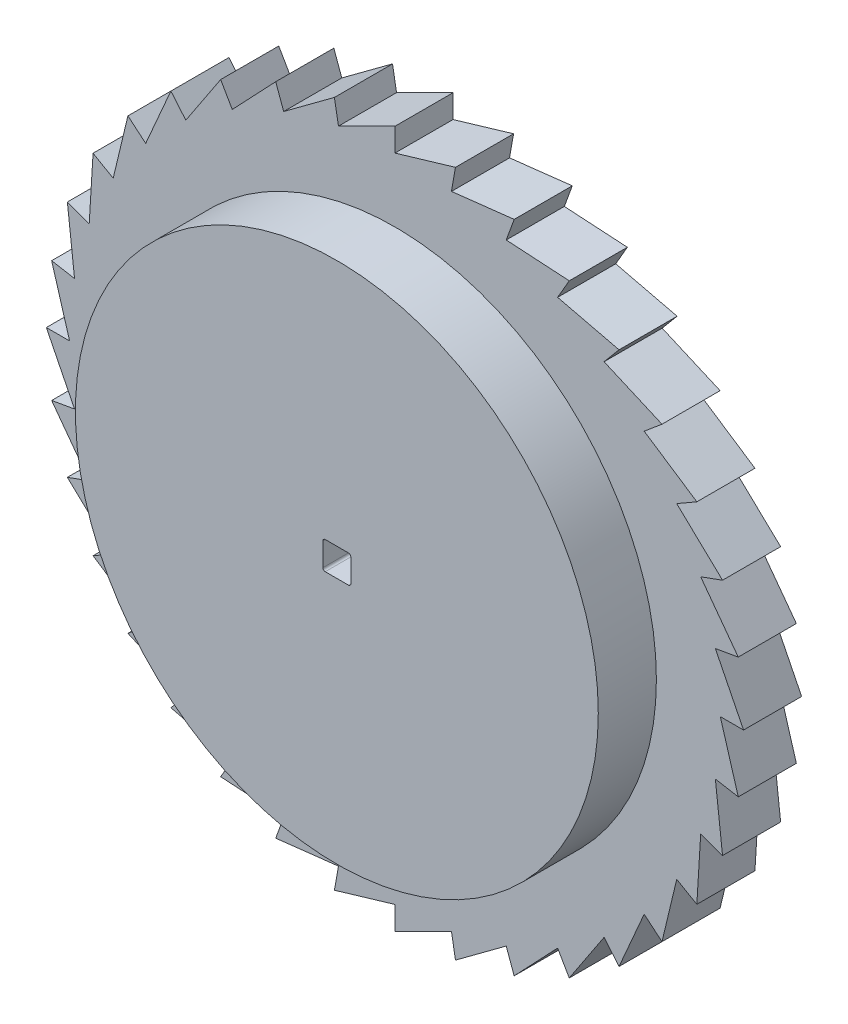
ISO-10303-21;
HEADER;
FILE_DESCRIPTION(('STEP AP214'),'2;1');
FILE_NAME('part.step','',(''),(''),'','','');
FILE_SCHEMA(('AUTOMOTIVE_DESIGN { 1 0 10303 214 1 1 1 1 }'));
ENDSEC;
DATA;
#1=APPLICATION_CONTEXT('core data for automotive mechanical design processes');
#2=APPLICATION_PROTOCOL_DEFINITION('international standard','automotive_design',2000,#1);
#3=PRODUCT_CONTEXT('',#1,'mechanical');
#4=PRODUCT('Part','Part','',(#3));
#5=PRODUCT_RELATED_PRODUCT_CATEGORY('part','',(#4));
#6=PRODUCT_DEFINITION_FORMATION('','',#4);
#7=PRODUCT_DEFINITION_CONTEXT('part definition',#1,'design');
#8=PRODUCT_DEFINITION('design','',#6,#7);
#9=PRODUCT_DEFINITION_SHAPE('','',#8);
#10=(LENGTH_UNIT() NAMED_UNIT(*) SI_UNIT(.MILLI.,.METRE.));
#11=(NAMED_UNIT(*) PLANE_ANGLE_UNIT() SI_UNIT($,.RADIAN.));
#12=(NAMED_UNIT(*) SI_UNIT($,.STERADIAN.) SOLID_ANGLE_UNIT());
#13=UNCERTAINTY_MEASURE_WITH_UNIT(LENGTH_MEASURE(1.E-05),#10,'distance_accuracy_value','');
#14=(GEOMETRIC_REPRESENTATION_CONTEXT(3) GLOBAL_UNCERTAINTY_ASSIGNED_CONTEXT((#13)) GLOBAL_UNIT_ASSIGNED_CONTEXT((#10,
#11,#12)) REPRESENTATION_CONTEXT('',''));
#15=CARTESIAN_POINT('',(0.,0.,0.));
#16=DIRECTION('',(0.,0.,1.));
#17=DIRECTION('',(1.,0.,0.));
#18=AXIS2_PLACEMENT_3D('',#15,#16,#17);
#19=CARTESIAN_POINT('',(6.17492919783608,35.0197636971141,6.35));
#20=DIRECTION('',(-0.98480775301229,0.173648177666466,0.));
#21=DIRECTION('',(-0.173648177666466,-0.98480775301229,0.));
#22=AXIS2_PLACEMENT_3D('',#19,#20,#21);
#23=PLANE('',#22);
#24=DIRECTION('',(0.173648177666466,0.98480775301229,0.));
#25=VECTOR('',#24,1.);
#26=CARTESIAN_POINT('',(6.17492919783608,35.0197636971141,0.));
#27=LINE('',#26,#25);
#28=CARTESIAN_POINT('',(6.17492919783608,35.0197636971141,0.));
#29=VERTEX_POINT('',#28);
#30=CARTESIAN_POINT('',(6.61599556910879,37.5211753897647,0.));
#31=VERTEX_POINT('',#30);
#32=EDGE_CURVE('E553',#29,#31,#27,.T.);
#33=ORIENTED_EDGE('',*,*,#32,.T.);
#34=DIRECTION('',(0.,0.,-1.));
#35=VECTOR('',#34,1.);
#36=CARTESIAN_POINT('',(6.61599556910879,37.5211753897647,6.35));
#37=LINE('',#36,#35);
#38=CARTESIAN_POINT('',(6.61599556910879,37.5211753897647,6.35));
#39=VERTEX_POINT('',#38);
#40=EDGE_CURVE('E534',#39,#31,#37,.T.);
#41=ORIENTED_EDGE('',*,*,#40,.F.);
#42=DIRECTION('',(0.173648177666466,0.98480775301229,0.));
#43=VECTOR('',#42,1.);
#44=CARTESIAN_POINT('',(6.17492919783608,35.0197636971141,6.35));
#45=LINE('',#44,#43);
#46=CARTESIAN_POINT('',(6.17492919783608,35.0197636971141,6.35));
#47=VERTEX_POINT('',#46);
#48=EDGE_CURVE('E541',#47,#39,#45,.T.);
#49=ORIENTED_EDGE('',*,*,#48,.F.);
#50=DIRECTION('',(0.,0.,-1.));
#51=VECTOR('',#50,1.);
#52=CARTESIAN_POINT('',(6.17492919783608,35.0197636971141,6.35));
#53=LINE('',#52,#51);
#54=EDGE_CURVE('E771',#47,#29,#53,.T.);
#55=ORIENTED_EDGE('',*,*,#54,.T.);
#56=EDGE_LOOP('',(#33,#41,#49,#55));
#57=FACE_BOUND('',#56,.T.);
#58=ADVANCED_FACE('F32',(#57),#23,.F.);
#59=CARTESIAN_POINT('',(0.,35.56,6.35));
#60=DIRECTION('',(0.284205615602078,-0.958763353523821,0.));
#61=DIRECTION('',(0.958763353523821,0.284205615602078,0.));
#62=AXIS2_PLACEMENT_3D('',#59,#60,#61);
#63=PLANE('',#62);
#64=DIRECTION('',(-0.958763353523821,-0.284205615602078,0.));
#65=VECTOR('',#64,1.);
#66=CARTESIAN_POINT('',(0.,35.56,0.));
#67=LINE('',#66,#65);
#68=CARTESIAN_POINT('',(0.,35.56,0.));
#69=VERTEX_POINT('',#68);
#70=EDGE_CURVE('E773',#31,#69,#67,.T.);
#71=ORIENTED_EDGE('',*,*,#70,.T.);
#72=DIRECTION('',(0.,0.,-1.));
#73=VECTOR('',#72,1.);
#74=CARTESIAN_POINT('',(0.,35.56,6.35));
#75=LINE('',#74,#73);
#76=CARTESIAN_POINT('',(0.,35.56,6.35));
#77=VERTEX_POINT('',#76);
#78=EDGE_CURVE('E537',#77,#69,#75,.T.);
#79=ORIENTED_EDGE('',*,*,#78,.F.);
#80=DIRECTION('',(-0.958763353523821,-0.284205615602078,0.));
#81=VECTOR('',#80,1.);
#82=CARTESIAN_POINT('',(0.,35.56,6.35));
#83=LINE('',#82,#81);
#84=EDGE_CURVE('E530',#39,#77,#83,.T.);
#85=ORIENTED_EDGE('',*,*,#84,.F.);
#86=ORIENTED_EDGE('',*,*,#40,.T.);
#87=EDGE_LOOP('',(#71,#79,#85,#86));
#88=FACE_BOUND('',#87,.T.);
#89=ADVANCED_FACE('F532',(#88),#63,.F.);
#90=CARTESIAN_POINT('',(0.,35.56,6.35));
#91=DIRECTION('',(-1.,-4.71570880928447E-13,0.));
#92=DIRECTION('',(4.71570880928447E-13,-1.,0.));
#93=AXIS2_PLACEMENT_3D('',#90,#91,#92);
#94=PLANE('',#93);
#95=DIRECTION('',(-4.71570880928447E-13,1.,0.));
#96=VECTOR('',#95,1.);
#97=CARTESIAN_POINT('',(0.,35.56,0.));
#98=LINE('',#97,#96);
#99=CARTESIAN_POINT('',(-1.19779003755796E-12,38.0999999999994,0.));
#100=VERTEX_POINT('',#99);
#101=EDGE_CURVE('E775',#69,#100,#98,.T.);
#102=ORIENTED_EDGE('',*,*,#101,.T.);
#103=DIRECTION('',(0.,0.,-1.));
#104=VECTOR('',#103,1.);
#105=CARTESIAN_POINT('',(-1.19779003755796E-12,38.0999999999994,6.35));
#106=LINE('',#105,#104);
#107=CARTESIAN_POINT('',(-1.19779003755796E-12,38.0999999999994,6.35));
#108=VERTEX_POINT('',#107);
#109=EDGE_CURVE('E558',#108,#100,#106,.T.);
#110=ORIENTED_EDGE('',*,*,#109,.F.);
#111=DIRECTION('',(-4.71570880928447E-13,1.,0.));
#112=VECTOR('',#111,1.);
#113=CARTESIAN_POINT('',(0.,35.56,6.35));
#114=LINE('',#113,#112);
#115=EDGE_CURVE('E540',#77,#108,#114,.T.);
#116=ORIENTED_EDGE('',*,*,#115,.F.);
#117=ORIENTED_EDGE('',*,*,#78,.T.);
#118=EDGE_LOOP('',(#102,#110,#116,#117));
#119=FACE_BOUND('',#118,.T.);
#120=ADVANCED_FACE('F1140',(#119),#94,.F.);
#121=CARTESIAN_POINT('',(-6.17492919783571,35.0197636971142,6.35));
#122=DIRECTION('',(0.446375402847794,-0.894845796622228,0.));
#123=DIRECTION('',(0.894845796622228,0.446375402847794,0.));
#124=AXIS2_PLACEMENT_3D('',#121,#122,#123);
#125=PLANE('',#124);
#126=DIRECTION('',(-0.894845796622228,-0.446375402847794,0.));
#127=VECTOR('',#126,1.);
#128=CARTESIAN_POINT('',(-6.17492919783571,35.0197636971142,0.));
#129=LINE('',#128,#127);
#130=CARTESIAN_POINT('',(-6.17492919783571,35.0197636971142,0.));
#131=VERTEX_POINT('',#130);
#132=EDGE_CURVE('E777',#100,#131,#129,.T.);
#133=ORIENTED_EDGE('',*,*,#132,.T.);
#134=DIRECTION('',(0.,0.,-1.));
#135=VECTOR('',#134,1.);
#136=CARTESIAN_POINT('',(-6.17492919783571,35.0197636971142,6.35));
#137=LINE('',#136,#135);
#138=CARTESIAN_POINT('',(-6.17492919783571,35.0197636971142,6.35));
#139=VERTEX_POINT('',#138);
#140=EDGE_CURVE('E1116',#139,#131,#137,.T.);
#141=ORIENTED_EDGE('',*,*,#140,.F.);
#142=DIRECTION('',(-0.894845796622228,-0.446375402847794,0.));
#143=VECTOR('',#142,1.);
#144=CARTESIAN_POINT('',(-6.17492919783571,35.0197636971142,6.35));
#145=LINE('',#144,#143);
#146=EDGE_CURVE('E634',#108,#139,#145,.T.);
#147=ORIENTED_EDGE('',*,*,#146,.F.);
#148=ORIENTED_EDGE('',*,*,#109,.T.);
#149=EDGE_LOOP('',(#133,#141,#147,#148));
#150=FACE_BOUND('',#149,.T.);
#151=ADVANCED_FACE('F1123',(#150),#125,.F.);
#152=CARTESIAN_POINT('',(-6.17492919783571,35.0197636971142,6.35));
#153=DIRECTION('',(-0.984807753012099,-0.173648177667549,0.));
#154=DIRECTION('',(0.173648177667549,-0.984807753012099,0.));
#155=AXIS2_PLACEMENT_3D('',#152,#153,#154);
#156=PLANE('',#155);
#157=DIRECTION('',(-0.173648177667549,0.984807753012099,0.));
#158=VECTOR('',#157,1.);
#159=CARTESIAN_POINT('',(-6.17492919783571,35.0197636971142,0.));
#160=LINE('',#159,#158);
#161=CARTESIAN_POINT('',(-6.61599556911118,37.5211753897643,0.));
#162=VERTEX_POINT('',#161);
#163=EDGE_CURVE('E779',#131,#162,#160,.T.);
#164=ORIENTED_EDGE('',*,*,#163,.T.);
#165=DIRECTION('',(0.,0.,-1.));
#166=VECTOR('',#165,1.);
#167=CARTESIAN_POINT('',(-6.61599556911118,37.5211753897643,6.35));
#168=LINE('',#167,#166);
#169=CARTESIAN_POINT('',(-6.61599556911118,37.5211753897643,6.35));
#170=VERTEX_POINT('',#169);
#171=EDGE_CURVE('E1113',#170,#162,#168,.T.);
#172=ORIENTED_EDGE('',*,*,#171,.F.);
#173=DIRECTION('',(-0.173648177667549,0.984807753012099,0.));
#174=VECTOR('',#173,1.);
#175=CARTESIAN_POINT('',(-6.17492919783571,35.0197636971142,6.35));
#176=LINE('',#175,#174);
#177=EDGE_CURVE('E636',#139,#170,#176,.T.);
#178=ORIENTED_EDGE('',*,*,#177,.F.);
#179=ORIENTED_EDGE('',*,*,#140,.T.);
#180=EDGE_LOOP('',(#164,#172,#178,#179));
#181=FACE_BOUND('',#180,.T.);
#182=ADVANCED_FACE('F1132',(#181),#156,.F.);
#183=CARTESIAN_POINT('',(-12.1622362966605,33.415469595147,6.35));
#184=DIRECTION('',(0.594982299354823,-0.80373880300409,0.));
#185=DIRECTION('',(0.80373880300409,0.594982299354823,0.));
#186=AXIS2_PLACEMENT_3D('',#183,#184,#185);
#187=PLANE('',#186);
#188=DIRECTION('',(-0.80373880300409,-0.594982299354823,0.));
#189=VECTOR('',#188,1.);
#190=CARTESIAN_POINT('',(-12.1622362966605,33.415469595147,0.));
#191=LINE('',#190,#189);
#192=CARTESIAN_POINT('',(-12.1622362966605,33.415469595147,0.));
#193=VERTEX_POINT('',#192);
#194=EDGE_CURVE('E781',#162,#193,#191,.T.);
#195=ORIENTED_EDGE('',*,*,#194,.T.);
#196=DIRECTION('',(0.,0.,-1.));
#197=VECTOR('',#196,1.);
#198=CARTESIAN_POINT('',(-12.1622362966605,33.415469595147,6.35));
#199=LINE('',#198,#197);
#200=CARTESIAN_POINT('',(-12.1622362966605,33.415469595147,6.35));
#201=VERTEX_POINT('',#200);
#202=EDGE_CURVE('E1110',#201,#193,#199,.T.);
#203=ORIENTED_EDGE('',*,*,#202,.F.);
#204=DIRECTION('',(-0.80373880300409,-0.594982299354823,0.));
#205=VECTOR('',#204,1.);
#206=CARTESIAN_POINT('',(-12.1622362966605,33.415469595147,6.35));
#207=LINE('',#206,#205);
#208=EDGE_CURVE('E638',#170,#201,#207,.T.);
#209=ORIENTED_EDGE('',*,*,#208,.F.);
#210=ORIENTED_EDGE('',*,*,#171,.T.);
#211=EDGE_LOOP('',(#195,#203,#209,#210));
#212=FACE_BOUND('',#211,.T.);
#213=ADVANCED_FACE('F1136',(#212),#187,.F.);
#214=CARTESIAN_POINT('',(-12.1622362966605,33.415469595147,6.35));
#215=DIRECTION('',(-0.93969262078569,-0.342020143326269,0.));
#216=DIRECTION('',(0.342020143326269,-0.93969262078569,0.));
#217=AXIS2_PLACEMENT_3D('',#214,#215,#216);
#218=PLANE('',#217);
#219=DIRECTION('',(-0.342020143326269,0.93969262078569,0.));
#220=VECTOR('',#219,1.);
#221=CARTESIAN_POINT('',(-12.1622362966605,33.415469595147,0.));
#222=LINE('',#221,#220);
#223=CARTESIAN_POINT('',(-13.030967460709,35.8022888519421,0.));
#224=VERTEX_POINT('',#223);
#225=EDGE_CURVE('E783',#193,#224,#222,.T.);
#226=ORIENTED_EDGE('',*,*,#225,.T.);
#227=DIRECTION('',(0.,0.,-1.));
#228=VECTOR('',#227,1.);
#229=CARTESIAN_POINT('',(-13.030967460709,35.8022888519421,6.35));
#230=LINE('',#229,#228);
#231=CARTESIAN_POINT('',(-13.030967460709,35.8022888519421,6.35));
#232=VERTEX_POINT('',#231);
#233=EDGE_CURVE('E1107',#232,#224,#230,.T.);
#234=ORIENTED_EDGE('',*,*,#233,.F.);
#235=DIRECTION('',(-0.342020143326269,0.93969262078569,0.));
#236=VECTOR('',#235,1.);
#237=CARTESIAN_POINT('',(-12.1622362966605,33.415469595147,6.35));
#238=LINE('',#237,#236);
#239=EDGE_CURVE('E640',#201,#232,#238,.T.);
#240=ORIENTED_EDGE('',*,*,#239,.F.);
#241=ORIENTED_EDGE('',*,*,#202,.T.);
#242=EDGE_LOOP('',(#226,#234,#240,#241));
#243=FACE_BOUND('',#242,.T.);
#244=ADVANCED_FACE('F1461',(#243),#218,.F.);
#245=CARTESIAN_POINT('',(-17.7799999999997,30.7958633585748,6.35));
#246=DIRECTION('',(0.725510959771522,-0.688210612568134,0.));
#247=DIRECTION('',(0.688210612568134,0.725510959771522,0.));
#248=AXIS2_PLACEMENT_3D('',#245,#246,#247);
#249=PLANE('',#248);
#250=DIRECTION('',(-0.688210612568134,-0.725510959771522,0.));
#251=VECTOR('',#250,1.);
#252=CARTESIAN_POINT('',(-17.7799999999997,30.7958633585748,0.));
#253=LINE('',#252,#251);
#254=CARTESIAN_POINT('',(-17.7799999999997,30.7958633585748,0.));
#255=VERTEX_POINT('',#254);
#256=EDGE_CURVE('E785',#224,#255,#253,.T.);
#257=ORIENTED_EDGE('',*,*,#256,.T.);
#258=DIRECTION('',(0.,0.,-1.));
#259=VECTOR('',#258,1.);
#260=CARTESIAN_POINT('',(-17.7799999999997,30.7958633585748,6.35));
#261=LINE('',#260,#259);
#262=CARTESIAN_POINT('',(-17.7799999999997,30.7958633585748,6.35));
#263=VERTEX_POINT('',#262);
#264=EDGE_CURVE('E1104',#263,#255,#261,.T.);
#265=ORIENTED_EDGE('',*,*,#264,.F.);
#266=DIRECTION('',(-0.688210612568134,-0.725510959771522,0.));
#267=VECTOR('',#266,1.);
#268=CARTESIAN_POINT('',(-17.7799999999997,30.7958633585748,6.35));
#269=LINE('',#268,#267);
#270=EDGE_CURVE('E642',#232,#263,#269,.T.);
#271=ORIENTED_EDGE('',*,*,#270,.F.);
#272=ORIENTED_EDGE('',*,*,#233,.T.);
#273=EDGE_LOOP('',(#257,#265,#271,#272));
#274=FACE_BOUND('',#273,.T.);
#275=ADVANCED_FACE('F1457',(#274),#249,.F.);
#276=CARTESIAN_POINT('',(-17.7799999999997,30.7958633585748,6.35));
#277=DIRECTION('',(-0.866025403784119,-0.500000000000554,0.));
#278=DIRECTION('',(0.500000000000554,-0.866025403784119,0.));
#279=AXIS2_PLACEMENT_3D('',#276,#277,#278);
#280=PLANE('',#279);
#281=DIRECTION('',(-0.500000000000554,0.866025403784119,0.));
#282=VECTOR('',#281,1.);
#283=CARTESIAN_POINT('',(-17.7799999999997,30.7958633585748,0.));
#284=LINE('',#283,#282);
#285=CARTESIAN_POINT('',(-19.0500000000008,32.9955678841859,0.));
#286=VERTEX_POINT('',#285);
#287=EDGE_CURVE('E787',#255,#286,#284,.T.);
#288=ORIENTED_EDGE('',*,*,#287,.T.);
#289=DIRECTION('',(0.,0.,-1.));
#290=VECTOR('',#289,1.);
#291=CARTESIAN_POINT('',(-19.0500000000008,32.9955678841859,6.35));
#292=LINE('',#291,#290);
#293=CARTESIAN_POINT('',(-19.0500000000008,32.9955678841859,6.35));
#294=VERTEX_POINT('',#293);
#295=EDGE_CURVE('E1101',#294,#286,#292,.T.);
#296=ORIENTED_EDGE('',*,*,#295,.F.);
#297=DIRECTION('',(-0.500000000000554,0.866025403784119,0.));
#298=VECTOR('',#297,1.);
#299=CARTESIAN_POINT('',(-17.7799999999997,30.7958633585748,6.35));
#300=LINE('',#299,#298);
#301=EDGE_CURVE('E644',#263,#294,#300,.T.);
#302=ORIENTED_EDGE('',*,*,#301,.F.);
#303=ORIENTED_EDGE('',*,*,#264,.T.);
#304=EDGE_LOOP('',(#288,#296,#302,#303));
#305=FACE_BOUND('',#304,.T.);
#306=ADVANCED_FACE('F1453',(#305),#280,.F.);
#307=CARTESIAN_POINT('',(-22.8575274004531,27.2405403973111,6.35));
#308=DIRECTION('',(0.833995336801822,-0.551771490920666,0.));
#309=DIRECTION('',(0.551771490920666,0.833995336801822,0.));
#310=AXIS2_PLACEMENT_3D('',#307,#308,#309);
#311=PLANE('',#310);
#312=DIRECTION('',(-0.551771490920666,-0.833995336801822,0.));
#313=VECTOR('',#312,1.);
#314=CARTESIAN_POINT('',(-22.8575274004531,27.2405403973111,0.));
#315=LINE('',#314,#313);
#316=CARTESIAN_POINT('',(-22.8575274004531,27.2405403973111,0.));
#317=VERTEX_POINT('',#316);
#318=EDGE_CURVE('E789',#286,#317,#315,.T.);
#319=ORIENTED_EDGE('',*,*,#318,.T.);
#320=DIRECTION('',(0.,0.,-1.));
#321=VECTOR('',#320,1.);
#322=CARTESIAN_POINT('',(-22.8575274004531,27.2405403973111,6.35));
#323=LINE('',#322,#321);
#324=CARTESIAN_POINT('',(-22.8575274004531,27.2405403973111,6.35));
#325=VERTEX_POINT('',#324);
#326=EDGE_CURVE('E1098',#325,#317,#323,.T.);
#327=ORIENTED_EDGE('',*,*,#326,.F.);
#328=DIRECTION('',(-0.551771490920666,-0.833995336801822,0.));
#329=VECTOR('',#328,1.);
#330=CARTESIAN_POINT('',(-22.8575274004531,27.2405403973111,6.35));
#331=LINE('',#330,#329);
#332=EDGE_CURVE('E646',#294,#325,#331,.T.);
#333=ORIENTED_EDGE('',*,*,#332,.F.);
#334=ORIENTED_EDGE('',*,*,#295,.T.);
#335=EDGE_LOOP('',(#319,#327,#333,#334));
#336=FACE_BOUND('',#335,.T.);
#337=ADVANCED_FACE('F1449',(#336),#311,.F.);
#338=CARTESIAN_POINT('',(-22.8575274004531,27.2405403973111,6.35));
#339=DIRECTION('',(-0.76604444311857,-0.642787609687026,0.));
#340=DIRECTION('',(0.642787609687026,-0.76604444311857,0.));
#341=AXIS2_PLACEMENT_3D('',#338,#339,#340);
#342=PLANE('',#341);
#343=DIRECTION('',(-0.642787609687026,0.76604444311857,0.));
#344=VECTOR('',#343,1.);
#345=CARTESIAN_POINT('',(-22.8575274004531,27.2405403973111,0.));
#346=LINE('',#345,#344);
#347=CARTESIAN_POINT('',(-24.4902079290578,29.1862932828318,0.));
#348=VERTEX_POINT('',#347);
#349=EDGE_CURVE('E791',#317,#348,#346,.T.);
#350=ORIENTED_EDGE('',*,*,#349,.T.);
#351=DIRECTION('',(0.,0.,-1.));
#352=VECTOR('',#351,1.);
#353=CARTESIAN_POINT('',(-24.4902079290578,29.1862932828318,6.35));
#354=LINE('',#353,#352);
#355=CARTESIAN_POINT('',(-24.4902079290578,29.1862932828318,6.35));
#356=VERTEX_POINT('',#355);
#357=EDGE_CURVE('E1095',#356,#348,#354,.T.);
#358=ORIENTED_EDGE('',*,*,#357,.F.);
#359=DIRECTION('',(-0.642787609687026,0.76604444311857,0.));
#360=VECTOR('',#359,1.);
#361=CARTESIAN_POINT('',(-22.8575274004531,27.2405403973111,6.35));
#362=LINE('',#361,#360);
#363=EDGE_CURVE('E648',#325,#356,#362,.T.);
#364=ORIENTED_EDGE('',*,*,#363,.F.);
#365=ORIENTED_EDGE('',*,*,#326,.T.);
#366=EDGE_LOOP('',(#350,#358,#364,#365));
#367=FACE_BOUND('',#366,.T.);
#368=ADVANCED_FACE('F1445',(#367),#342,.F.);
#369=CARTESIAN_POINT('',(-27.2405403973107,22.8575274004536,6.35));
#370=DIRECTION('',(0.917139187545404,-0.398567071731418,0.));
#371=DIRECTION('',(0.398567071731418,0.917139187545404,0.));
#372=AXIS2_PLACEMENT_3D('',#369,#370,#371);
#373=PLANE('',#372);
#374=DIRECTION('',(-0.398567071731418,-0.917139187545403,0.));
#375=VECTOR('',#374,1.);
#376=CARTESIAN_POINT('',(-27.2405403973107,22.8575274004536,0.));
#377=LINE('',#376,#375);
#378=CARTESIAN_POINT('',(-27.2405403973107,22.8575274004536,0.));
#379=VERTEX_POINT('',#378);
#380=EDGE_CURVE('E793',#348,#379,#377,.T.);
#381=ORIENTED_EDGE('',*,*,#380,.T.);
#382=DIRECTION('',(0.,0.,-1.));
#383=VECTOR('',#382,1.);
#384=CARTESIAN_POINT('',(-27.2405403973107,22.8575274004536,6.35));
#385=LINE('',#384,#383);
#386=CARTESIAN_POINT('',(-27.2405403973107,22.8575274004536,6.35));
#387=VERTEX_POINT('',#386);
#388=EDGE_CURVE('E1092',#387,#379,#385,.T.);
#389=ORIENTED_EDGE('',*,*,#388,.F.);
#390=DIRECTION('',(-0.398567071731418,-0.917139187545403,0.));
#391=VECTOR('',#390,1.);
#392=CARTESIAN_POINT('',(-27.2405403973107,22.8575274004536,6.35));
#393=LINE('',#392,#391);
#394=EDGE_CURVE('E650',#356,#387,#393,.T.);
#395=ORIENTED_EDGE('',*,*,#394,.F.);
#396=ORIENTED_EDGE('',*,*,#357,.T.);
#397=EDGE_LOOP('',(#381,#389,#395,#396));
#398=FACE_BOUND('',#397,.T.);
#399=ADVANCED_FACE('F1441',(#398),#373,.F.);
#400=CARTESIAN_POINT('',(-27.2405403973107,22.8575274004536,6.35));
#401=DIRECTION('',(-0.642787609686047,-0.766044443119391,0.));
#402=DIRECTION('',(0.766044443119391,-0.642787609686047,0.));
#403=AXIS2_PLACEMENT_3D('',#400,#401,#402);
#404=PLANE('',#403);
#405=DIRECTION('',(-0.766044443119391,0.642787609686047,0.));
#406=VECTOR('',#405,1.);
#407=CARTESIAN_POINT('',(-27.2405403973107,22.8575274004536,0.));
#408=LINE('',#407,#406);
#409=CARTESIAN_POINT('',(-29.1862932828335,24.4902079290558,0.));
#410=VERTEX_POINT('',#409);
#411=EDGE_CURVE('E795',#379,#410,#408,.T.);
#412=ORIENTED_EDGE('',*,*,#411,.T.);
#413=DIRECTION('',(0.,0.,-1.));
#414=VECTOR('',#413,1.);
#415=CARTESIAN_POINT('',(-29.1862932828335,24.4902079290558,6.35));
#416=LINE('',#415,#414);
#417=CARTESIAN_POINT('',(-29.1862932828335,24.4902079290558,6.35));
#418=VERTEX_POINT('',#417);
#419=EDGE_CURVE('E1089',#418,#410,#416,.T.);
#420=ORIENTED_EDGE('',*,*,#419,.F.);
#421=DIRECTION('',(-0.766044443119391,0.642787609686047,0.));
#422=VECTOR('',#421,1.);
#423=CARTESIAN_POINT('',(-27.2405403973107,22.8575274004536,6.35));
#424=LINE('',#423,#422);
#425=EDGE_CURVE('E652',#387,#418,#424,.T.);
#426=ORIENTED_EDGE('',*,*,#425,.F.);
#427=ORIENTED_EDGE('',*,*,#388,.T.);
#428=EDGE_LOOP('',(#412,#420,#426,#427));
#429=FACE_BOUND('',#428,.T.);
#430=ADVANCED_FACE('F1437',(#429),#404,.F.);
#431=CARTESIAN_POINT('',(-30.7958633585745,17.7800000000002,6.35));
#432=DIRECTION('',(0.972416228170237,-0.233252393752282,0.));
#433=DIRECTION('',(0.233252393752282,0.972416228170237,0.));
#434=AXIS2_PLACEMENT_3D('',#431,#432,#433);
#435=PLANE('',#434);
#436=DIRECTION('',(-0.233252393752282,-0.972416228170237,0.));
#437=VECTOR('',#436,1.);
#438=CARTESIAN_POINT('',(-30.7958633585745,17.7800000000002,0.));
#439=LINE('',#438,#437);
#440=CARTESIAN_POINT('',(-30.7958633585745,17.7800000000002,0.));
#441=VERTEX_POINT('',#440);
#442=EDGE_CURVE('E797',#410,#441,#439,.T.);
#443=ORIENTED_EDGE('',*,*,#442,.T.);
#444=DIRECTION('',(0.,0.,-1.));
#445=VECTOR('',#444,1.);
#446=CARTESIAN_POINT('',(-30.7958633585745,17.7800000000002,6.35));
#447=LINE('',#446,#445);
#448=CARTESIAN_POINT('',(-30.7958633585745,17.7800000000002,6.35));
#449=VERTEX_POINT('',#448);
#450=EDGE_CURVE('E1086',#449,#441,#447,.T.);
#451=ORIENTED_EDGE('',*,*,#450,.F.);
#452=DIRECTION('',(-0.233252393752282,-0.972416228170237,0.));
#453=VECTOR('',#452,1.);
#454=CARTESIAN_POINT('',(-30.7958633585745,17.7800000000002,6.35));
#455=LINE('',#454,#453);
#456=EDGE_CURVE('E654',#418,#449,#455,.T.);
#457=ORIENTED_EDGE('',*,*,#456,.F.);
#458=ORIENTED_EDGE('',*,*,#419,.T.);
#459=EDGE_LOOP('',(#443,#451,#457,#458));
#460=FACE_BOUND('',#459,.T.);
#461=ADVANCED_FACE('F1433',(#460),#435,.F.);
#462=CARTESIAN_POINT('',(-30.7958633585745,17.7800000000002,6.35));
#463=DIRECTION('',(-0.499999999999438,-0.866025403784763,0.));
#464=DIRECTION('',(0.866025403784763,-0.499999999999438,0.));
#465=AXIS2_PLACEMENT_3D('',#462,#463,#464);
#466=PLANE('',#465);
#467=DIRECTION('',(-0.866025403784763,0.499999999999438,0.));
#468=VECTOR('',#467,1.);
#469=CARTESIAN_POINT('',(-30.7958633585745,17.7800000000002,0.));
#470=LINE('',#469,#468);
#471=CARTESIAN_POINT('',(-32.9955678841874,19.0499999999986,0.));
#472=VERTEX_POINT('',#471);
#473=EDGE_CURVE('E799',#441,#472,#470,.T.);
#474=ORIENTED_EDGE('',*,*,#473,.T.);
#475=DIRECTION('',(0.,0.,-1.));
#476=VECTOR('',#475,1.);
#477=CARTESIAN_POINT('',(-32.9955678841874,19.0499999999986,6.35));
#478=LINE('',#477,#476);
#479=CARTESIAN_POINT('',(-32.9955678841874,19.0499999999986,6.35));
#480=VERTEX_POINT('',#479);
#481=EDGE_CURVE('E1083',#480,#472,#478,.T.);
#482=ORIENTED_EDGE('',*,*,#481,.F.);
#483=DIRECTION('',(-0.866025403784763,0.499999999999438,0.));
#484=VECTOR('',#483,1.);
#485=CARTESIAN_POINT('',(-30.7958633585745,17.7800000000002,6.35));
#486=LINE('',#485,#484);
#487=EDGE_CURVE('E656',#449,#480,#486,.T.);
#488=ORIENTED_EDGE('',*,*,#487,.F.);
#489=ORIENTED_EDGE('',*,*,#450,.T.);
#490=EDGE_LOOP('',(#474,#482,#488,#489));
#491=FACE_BOUND('',#490,.T.);
#492=ADVANCED_FACE('F1429',(#491),#466,.F.);
#493=CARTESIAN_POINT('',(-33.4154695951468,12.162236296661,6.35));
#494=DIRECTION('',(0.998146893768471,-0.0608504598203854,0.));
#495=DIRECTION('',(0.0608504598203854,0.998146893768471,0.));
#496=AXIS2_PLACEMENT_3D('',#493,#494,#495);
#497=PLANE('',#496);
#498=DIRECTION('',(-0.0608504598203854,-0.998146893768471,0.));
#499=VECTOR('',#498,1.);
#500=CARTESIAN_POINT('',(-33.4154695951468,12.162236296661,0.));
#501=LINE('',#500,#499);
#502=CARTESIAN_POINT('',(-33.4154695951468,12.162236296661,0.));
#503=VERTEX_POINT('',#502);
#504=EDGE_CURVE('E801',#472,#503,#501,.T.);
#505=ORIENTED_EDGE('',*,*,#504,.T.);
#506=DIRECTION('',(0.,0.,-1.));
#507=VECTOR('',#506,1.);
#508=CARTESIAN_POINT('',(-33.4154695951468,12.162236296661,6.35));
#509=LINE('',#508,#507);
#510=CARTESIAN_POINT('',(-33.4154695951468,12.162236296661,6.35));
#511=VERTEX_POINT('',#510);
#512=EDGE_CURVE('E1080',#511,#503,#509,.T.);
#513=ORIENTED_EDGE('',*,*,#512,.F.);
#514=DIRECTION('',(-0.0608504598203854,-0.998146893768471,0.));
#515=VECTOR('',#514,1.);
#516=CARTESIAN_POINT('',(-33.4154695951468,12.162236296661,6.35));
#517=LINE('',#516,#515);
#518=EDGE_CURVE('E658',#480,#511,#517,.T.);
#519=ORIENTED_EDGE('',*,*,#518,.F.);
#520=ORIENTED_EDGE('',*,*,#481,.T.);
#521=EDGE_LOOP('',(#505,#513,#519,#520));
#522=FACE_BOUND('',#521,.T.);
#523=ADVANCED_FACE('F1425',(#522),#497,.F.);
#524=CARTESIAN_POINT('',(-33.4154695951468,12.162236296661,6.35));
#525=DIRECTION('',(-0.342020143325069,-0.939692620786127,0.));
#526=DIRECTION('',(0.939692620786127,-0.342020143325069,0.));
#527=AXIS2_PLACEMENT_3D('',#524,#525,#526);
#528=PLANE('',#527);
#529=DIRECTION('',(-0.939692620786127,0.342020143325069,0.));
#530=VECTOR('',#529,1.);
#531=CARTESIAN_POINT('',(-33.4154695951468,12.162236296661,0.));
#532=LINE('',#531,#530);
#533=CARTESIAN_POINT('',(-35.8022888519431,13.0309674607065,0.));
#534=VERTEX_POINT('',#533);
#535=EDGE_CURVE('E803',#503,#534,#532,.T.);
#536=ORIENTED_EDGE('',*,*,#535,.T.);
#537=DIRECTION('',(0.,0.,-1.));
#538=VECTOR('',#537,1.);
#539=CARTESIAN_POINT('',(-35.8022888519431,13.0309674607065,6.35));
#540=LINE('',#539,#538);
#541=CARTESIAN_POINT('',(-35.8022888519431,13.0309674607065,6.35));
#542=VERTEX_POINT('',#541);
#543=EDGE_CURVE('E1077',#542,#534,#540,.T.);
#544=ORIENTED_EDGE('',*,*,#543,.F.);
#545=DIRECTION('',(-0.939692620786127,0.342020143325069,0.));
#546=VECTOR('',#545,1.);
#547=CARTESIAN_POINT('',(-33.4154695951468,12.162236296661,6.35));
#548=LINE('',#547,#546);
#549=EDGE_CURVE('E660',#511,#542,#548,.T.);
#550=ORIENTED_EDGE('',*,*,#549,.F.);
#551=ORIENTED_EDGE('',*,*,#512,.T.);
#552=EDGE_LOOP('',(#536,#544,#550,#551));
#553=FACE_BOUND('',#552,.T.);
#554=ADVANCED_FACE('F1421',(#553),#528,.F.);
#555=CARTESIAN_POINT('',(-35.0197636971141,6.1749291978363,6.35));
#556=DIRECTION('',(0.993549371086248,0.113400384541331,0.));
#557=DIRECTION('',(-0.113400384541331,0.993549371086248,0.));
#558=AXIS2_PLACEMENT_3D('',#555,#556,#557);
#559=PLANE('',#558);
#560=DIRECTION('',(0.113400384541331,-0.993549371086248,0.));
#561=VECTOR('',#560,1.);
#562=CARTESIAN_POINT('',(-35.0197636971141,6.1749291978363,0.));
#563=LINE('',#562,#561);
#564=CARTESIAN_POINT('',(-35.0197636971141,6.1749291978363,0.));
#565=VERTEX_POINT('',#564);
#566=EDGE_CURVE('E805',#534,#565,#563,.T.);
#567=ORIENTED_EDGE('',*,*,#566,.T.);
#568=DIRECTION('',(0.,0.,-1.));
#569=VECTOR('',#568,1.);
#570=CARTESIAN_POINT('',(-35.0197636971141,6.1749291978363,6.35));
#571=LINE('',#570,#569);
#572=CARTESIAN_POINT('',(-35.0197636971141,6.1749291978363,6.35));
#573=VERTEX_POINT('',#572);
#574=EDGE_CURVE('E1074',#573,#565,#571,.T.);
#575=ORIENTED_EDGE('',*,*,#574,.F.);
#576=DIRECTION('',(0.113400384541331,-0.993549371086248,0.));
#577=VECTOR('',#576,1.);
#578=CARTESIAN_POINT('',(-35.0197636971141,6.1749291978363,6.35));
#579=LINE('',#578,#577);
#580=EDGE_CURVE('E662',#542,#573,#579,.T.);
#581=ORIENTED_EDGE('',*,*,#580,.F.);
#582=ORIENTED_EDGE('',*,*,#543,.T.);
#583=EDGE_LOOP('',(#567,#575,#581,#582));
#584=FACE_BOUND('',#583,.T.);
#585=ADVANCED_FACE('F1417',(#584),#559,.F.);
#586=CARTESIAN_POINT('',(-35.0197636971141,6.1749291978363,6.35));
#587=DIRECTION('',(-0.173648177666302,-0.984807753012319,0.));
#588=DIRECTION('',(0.984807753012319,-0.173648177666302,0.));
#589=AXIS2_PLACEMENT_3D('',#586,#587,#588);
#590=PLANE('',#589);
#591=DIRECTION('',(-0.984807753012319,0.173648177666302,0.));
#592=VECTOR('',#591,1.);
#593=CARTESIAN_POINT('',(-35.0197636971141,6.1749291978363,0.));
#594=LINE('',#593,#592);
#595=CARTESIAN_POINT('',(-37.5211753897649,6.61599556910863,0.));
#596=VERTEX_POINT('',#595);
#597=EDGE_CURVE('E807',#565,#596,#594,.T.);
#598=ORIENTED_EDGE('',*,*,#597,.T.);
#599=DIRECTION('',(0.,0.,-1.));
#600=VECTOR('',#599,1.);
#601=CARTESIAN_POINT('',(-37.5211753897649,6.61599556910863,6.35));
#602=LINE('',#601,#600);
#603=CARTESIAN_POINT('',(-37.5211753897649,6.61599556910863,6.35));
#604=VERTEX_POINT('',#603);
#605=EDGE_CURVE('E1071',#604,#596,#602,.T.);
#606=ORIENTED_EDGE('',*,*,#605,.F.);
#607=DIRECTION('',(-0.984807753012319,0.173648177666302,0.));
#608=VECTOR('',#607,1.);
#609=CARTESIAN_POINT('',(-35.0197636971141,6.1749291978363,6.35));
#610=LINE('',#609,#608);
#611=EDGE_CURVE('E664',#573,#604,#610,.T.);
#612=ORIENTED_EDGE('',*,*,#611,.F.);
#613=ORIENTED_EDGE('',*,*,#574,.T.);
#614=EDGE_LOOP('',(#598,#606,#612,#613));
#615=FACE_BOUND('',#614,.T.);
#616=ADVANCED_FACE('F1413',(#615),#590,.F.);
#617=CARTESIAN_POINT('',(-35.56,2.35055030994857E-13,6.35));
#618=DIRECTION('',(0.958763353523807,0.284205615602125,0.));
#619=DIRECTION('',(-0.284205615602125,0.958763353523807,0.));
#620=AXIS2_PLACEMENT_3D('',#617,#618,#619);
#621=PLANE('',#620);
#622=DIRECTION('',(0.284205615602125,-0.958763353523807,0.));
#623=VECTOR('',#622,1.);
#624=CARTESIAN_POINT('',(-35.56,2.35055030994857E-13,0.));
#625=LINE('',#624,#623);
#626=CARTESIAN_POINT('',(-35.56,2.35055030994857E-13,0.));
#627=VERTEX_POINT('',#626);
#628=EDGE_CURVE('E809',#596,#627,#625,.T.);
#629=ORIENTED_EDGE('',*,*,#628,.T.);
#630=DIRECTION('',(0.,0.,-1.));
#631=VECTOR('',#630,1.);
#632=CARTESIAN_POINT('',(-35.56,2.35055030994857E-13,6.35));
#633=LINE('',#632,#631);
#634=CARTESIAN_POINT('',(-35.56,2.35055030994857E-13,6.35));
#635=VERTEX_POINT('',#634);
#636=EDGE_CURVE('E1068',#635,#627,#633,.T.);
#637=ORIENTED_EDGE('',*,*,#636,.F.);
#638=DIRECTION('',(0.284205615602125,-0.958763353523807,0.));
#639=VECTOR('',#638,1.);
#640=CARTESIAN_POINT('',(-35.56,2.35055030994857E-13,6.35));
#641=LINE('',#640,#639);
#642=EDGE_CURVE('E666',#604,#635,#641,.T.);
#643=ORIENTED_EDGE('',*,*,#642,.F.);
#644=ORIENTED_EDGE('',*,*,#605,.T.);
#645=EDGE_LOOP('',(#629,#637,#643,#644));
#646=FACE_BOUND('',#645,.T.);
#647=ADVANCED_FACE('F1409',(#646),#621,.F.);
#648=CARTESIAN_POINT('',(-35.56,2.35055030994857E-13,6.35));
#649=DIRECTION('',(6.23289249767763E-13,-1.,0.));
#650=DIRECTION('',(1.,6.23289249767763E-13,0.));
#651=AXIS2_PLACEMENT_3D('',#648,#649,#650);
#652=PLANE('',#651);
#653=DIRECTION('',(-1.,-6.23289249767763E-13,0.));
#654=VECTOR('',#653,1.);
#655=CARTESIAN_POINT('',(-35.56,2.35055030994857E-13,0.));
#656=LINE('',#655,#654);
#657=CARTESIAN_POINT('',(-38.0999999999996,-1.34809966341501E-12,0.));
#658=VERTEX_POINT('',#657);
#659=EDGE_CURVE('E811',#627,#658,#656,.T.);
#660=ORIENTED_EDGE('',*,*,#659,.T.);
#661=DIRECTION('',(0.,0.,-1.));
#662=VECTOR('',#661,1.);
#663=CARTESIAN_POINT('',(-38.0999999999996,-1.34809966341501E-12,6.35));
#664=LINE('',#663,#662);
#665=CARTESIAN_POINT('',(-38.0999999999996,-1.34809966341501E-12,6.35));
#666=VERTEX_POINT('',#665);
#667=EDGE_CURVE('E1065',#666,#658,#664,.T.);
#668=ORIENTED_EDGE('',*,*,#667,.F.);
#669=DIRECTION('',(-1.,-6.23289249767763E-13,0.));
#670=VECTOR('',#669,1.);
#671=CARTESIAN_POINT('',(-35.56,2.35055030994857E-13,6.35));
#672=LINE('',#671,#670);
#673=EDGE_CURVE('E668',#635,#666,#672,.T.);
#674=ORIENTED_EDGE('',*,*,#673,.F.);
#675=ORIENTED_EDGE('',*,*,#636,.T.);
#676=EDGE_LOOP('',(#660,#668,#674,#675));
#677=FACE_BOUND('',#676,.T.);
#678=ADVANCED_FACE('F1405',(#677),#652,.F.);
#679=CARTESIAN_POINT('',(-35.0197636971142,-6.17492919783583,6.35));
#680=DIRECTION('',(0.894845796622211,0.446375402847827,0.));
#681=DIRECTION('',(-0.446375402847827,0.894845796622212,0.));
#682=AXIS2_PLACEMENT_3D('',#679,#680,#681);
#683=PLANE('',#682);
#684=DIRECTION('',(0.446375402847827,-0.894845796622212,0.));
#685=VECTOR('',#684,1.);
#686=CARTESIAN_POINT('',(-35.0197636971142,-6.17492919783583,0.));
#687=LINE('',#686,#685);
#688=CARTESIAN_POINT('',(-35.0197636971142,-6.17492919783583,0.));
#689=VERTEX_POINT('',#688);
#690=EDGE_CURVE('E813',#658,#689,#687,.T.);
#691=ORIENTED_EDGE('',*,*,#690,.T.);
#692=DIRECTION('',(0.,0.,-1.));
#693=VECTOR('',#692,1.);
#694=CARTESIAN_POINT('',(-35.0197636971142,-6.17492919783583,6.35));
#695=LINE('',#694,#693);
#696=CARTESIAN_POINT('',(-35.0197636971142,-6.17492919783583,6.35));
#697=VERTEX_POINT('',#696);
#698=EDGE_CURVE('E1062',#697,#689,#695,.T.);
#699=ORIENTED_EDGE('',*,*,#698,.F.);
#700=DIRECTION('',(0.446375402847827,-0.894845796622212,0.));
#701=VECTOR('',#700,1.);
#702=CARTESIAN_POINT('',(-35.0197636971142,-6.17492919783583,6.35));
#703=LINE('',#702,#701);
#704=EDGE_CURVE('E670',#666,#697,#703,.T.);
#705=ORIENTED_EDGE('',*,*,#704,.F.);
#706=ORIENTED_EDGE('',*,*,#667,.T.);
#707=EDGE_LOOP('',(#691,#699,#705,#706));
#708=FACE_BOUND('',#707,.T.);
#709=ADVANCED_FACE('F1401',(#708),#683,.F.);
#710=CARTESIAN_POINT('',(-35.0197636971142,-6.17492919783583,6.35));
#711=DIRECTION('',(0.173648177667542,-0.9848077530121,0.));
#712=DIRECTION('',(0.9848077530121,0.173648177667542,0.));
#713=AXIS2_PLACEMENT_3D('',#710,#711,#712);
#714=PLANE('',#713);
#715=DIRECTION('',(-0.9848077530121,-0.173648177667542,0.));
#716=VECTOR('',#715,1.);
#717=CARTESIAN_POINT('',(-35.0197636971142,-6.17492919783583,0.));
#718=LINE('',#717,#716);
#719=CARTESIAN_POINT('',(-37.5211753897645,-6.61599556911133,0.));
#720=VERTEX_POINT('',#719);
#721=EDGE_CURVE('E815',#689,#720,#718,.T.);
#722=ORIENTED_EDGE('',*,*,#721,.T.);
#723=DIRECTION('',(0.,0.,-1.));
#724=VECTOR('',#723,1.);
#725=CARTESIAN_POINT('',(-37.5211753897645,-6.61599556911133,6.35));
#726=LINE('',#725,#724);
#727=CARTESIAN_POINT('',(-37.5211753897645,-6.61599556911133,6.35));
#728=VERTEX_POINT('',#727);
#729=EDGE_CURVE('E1059',#728,#720,#726,.T.);
#730=ORIENTED_EDGE('',*,*,#729,.F.);
#731=DIRECTION('',(-0.9848077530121,-0.173648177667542,0.));
#732=VECTOR('',#731,1.);
#733=CARTESIAN_POINT('',(-35.0197636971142,-6.17492919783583,6.35));
#734=LINE('',#733,#732);
#735=EDGE_CURVE('E672',#697,#728,#734,.T.);
#736=ORIENTED_EDGE('',*,*,#735,.F.);
#737=ORIENTED_EDGE('',*,*,#698,.T.);
#738=EDGE_LOOP('',(#722,#730,#736,#737));
#739=FACE_BOUND('',#738,.T.);
#740=ADVANCED_FACE('F1397',(#739),#714,.F.);
#741=CARTESIAN_POINT('',(-33.415469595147,-12.1622362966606,6.35));
#742=DIRECTION('',(0.803738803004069,0.594982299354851,0.));
#743=DIRECTION('',(-0.594982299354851,0.803738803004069,0.));
#744=AXIS2_PLACEMENT_3D('',#741,#742,#743);
#745=PLANE('',#744);
#746=DIRECTION('',(0.594982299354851,-0.803738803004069,0.));
#747=VECTOR('',#746,1.);
#748=CARTESIAN_POINT('',(-33.415469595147,-12.1622362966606,0.));
#749=LINE('',#748,#747);
#750=CARTESIAN_POINT('',(-33.415469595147,-12.1622362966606,0.));
#751=VERTEX_POINT('',#750);
#752=EDGE_CURVE('E817',#720,#751,#749,.T.);
#753=ORIENTED_EDGE('',*,*,#752,.T.);
#754=DIRECTION('',(0.,0.,-1.));
#755=VECTOR('',#754,1.);
#756=CARTESIAN_POINT('',(-33.415469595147,-12.1622362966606,6.35));
#757=LINE('',#756,#755);
#758=CARTESIAN_POINT('',(-33.415469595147,-12.1622362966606,6.35));
#759=VERTEX_POINT('',#758);
#760=EDGE_CURVE('E1056',#759,#751,#757,.T.);
#761=ORIENTED_EDGE('',*,*,#760,.F.);
#762=DIRECTION('',(0.594982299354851,-0.803738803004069,0.));
#763=VECTOR('',#762,1.);
#764=CARTESIAN_POINT('',(-33.415469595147,-12.1622362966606,6.35));
#765=LINE('',#764,#763);
#766=EDGE_CURVE('E674',#728,#759,#765,.T.);
#767=ORIENTED_EDGE('',*,*,#766,.F.);
#768=ORIENTED_EDGE('',*,*,#729,.T.);
#769=EDGE_LOOP('',(#753,#761,#767,#768));
#770=FACE_BOUND('',#769,.T.);
#771=ADVANCED_FACE('F1393',(#770),#745,.F.);
#772=CARTESIAN_POINT('',(-33.415469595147,-12.1622362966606,6.35));
#773=DIRECTION('',(0.342020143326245,-0.939692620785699,0.));
#774=DIRECTION('',(0.939692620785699,0.342020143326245,0.));
#775=AXIS2_PLACEMENT_3D('',#772,#773,#774);
#776=PLANE('',#775);
#777=DIRECTION('',(-0.939692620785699,-0.342020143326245,0.));
#778=VECTOR('',#777,1.);
#779=CARTESIAN_POINT('',(-33.415469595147,-12.1622362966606,0.));
#780=LINE('',#779,#778);
#781=CARTESIAN_POINT('',(-35.8022888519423,-13.0309674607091,0.));
#782=VERTEX_POINT('',#781);
#783=EDGE_CURVE('E819',#751,#782,#780,.T.);
#784=ORIENTED_EDGE('',*,*,#783,.T.);
#785=DIRECTION('',(0.,0.,-1.));
#786=VECTOR('',#785,1.);
#787=CARTESIAN_POINT('',(-35.8022888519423,-13.0309674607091,6.35));
#788=LINE('',#787,#786);
#789=CARTESIAN_POINT('',(-35.8022888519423,-13.0309674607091,6.35));
#790=VERTEX_POINT('',#789);
#791=EDGE_CURVE('E1053',#790,#782,#788,.T.);
#792=ORIENTED_EDGE('',*,*,#791,.F.);
#793=DIRECTION('',(-0.939692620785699,-0.342020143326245,0.));
#794=VECTOR('',#793,1.);
#795=CARTESIAN_POINT('',(-33.415469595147,-12.1622362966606,6.35));
#796=LINE('',#795,#794);
#797=EDGE_CURVE('E676',#759,#790,#796,.T.);
#798=ORIENTED_EDGE('',*,*,#797,.F.);
#799=ORIENTED_EDGE('',*,*,#760,.T.);
#800=EDGE_LOOP('',(#784,#792,#798,#799));
#801=FACE_BOUND('',#800,.T.);
#802=ADVANCED_FACE('F1389',(#801),#776,.F.);
#803=CARTESIAN_POINT('',(-30.7958633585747,-17.7799999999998,6.35));
#804=DIRECTION('',(0.688210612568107,0.725510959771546,0.));
#805=DIRECTION('',(-0.725510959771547,0.688210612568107,0.));
#806=AXIS2_PLACEMENT_3D('',#803,#804,#805);
#807=PLANE('',#806);
#808=DIRECTION('',(0.725510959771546,-0.688210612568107,0.));
#809=VECTOR('',#808,1.);
#810=CARTESIAN_POINT('',(-30.7958633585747,-17.7799999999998,0.));
#811=LINE('',#810,#809);
#812=CARTESIAN_POINT('',(-30.7958633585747,-17.7799999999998,0.));
#813=VERTEX_POINT('',#812);
#814=EDGE_CURVE('E821',#782,#813,#811,.T.);
#815=ORIENTED_EDGE('',*,*,#814,.T.);
#816=DIRECTION('',(0.,0.,-1.));
#817=VECTOR('',#816,1.);
#818=CARTESIAN_POINT('',(-30.7958633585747,-17.7799999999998,6.35));
#819=LINE('',#818,#817);
#820=CARTESIAN_POINT('',(-30.7958633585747,-17.7799999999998,6.35));
#821=VERTEX_POINT('',#820);
#822=EDGE_CURVE('E1050',#821,#813,#819,.T.);
#823=ORIENTED_EDGE('',*,*,#822,.F.);
#824=DIRECTION('',(0.725510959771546,-0.688210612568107,0.));
#825=VECTOR('',#824,1.);
#826=CARTESIAN_POINT('',(-30.7958633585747,-17.7799999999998,6.35));
#827=LINE('',#826,#825);
#828=EDGE_CURVE('E678',#790,#821,#827,.T.);
#829=ORIENTED_EDGE('',*,*,#828,.F.);
#830=ORIENTED_EDGE('',*,*,#791,.T.);
#831=EDGE_LOOP('',(#815,#823,#829,#830));
#832=FACE_BOUND('',#831,.T.);
#833=ADVANCED_FACE('F1385',(#832),#807,.F.);
#834=CARTESIAN_POINT('',(-30.7958633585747,-17.7799999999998,6.35));
#835=DIRECTION('',(0.500000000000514,-0.866025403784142,0.));
#836=DIRECTION('',(0.866025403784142,0.500000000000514,0.));
#837=AXIS2_PLACEMENT_3D('',#834,#835,#836);
#838=PLANE('',#837);
#839=DIRECTION('',(-0.866025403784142,-0.500000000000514,0.));
#840=VECTOR('',#839,1.);
#841=CARTESIAN_POINT('',(-30.7958633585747,-17.7799999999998,0.));
#842=LINE('',#841,#840);
#843=CARTESIAN_POINT('',(-32.9955678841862,-19.050000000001,0.));
#844=VERTEX_POINT('',#843);
#845=EDGE_CURVE('E823',#813,#844,#842,.T.);
#846=ORIENTED_EDGE('',*,*,#845,.T.);
#847=DIRECTION('',(0.,0.,-1.));
#848=VECTOR('',#847,1.);
#849=CARTESIAN_POINT('',(-32.9955678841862,-19.050000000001,6.35));
#850=LINE('',#849,#848);
#851=CARTESIAN_POINT('',(-32.9955678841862,-19.050000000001,6.35));
#852=VERTEX_POINT('',#851);
#853=EDGE_CURVE('E1047',#852,#844,#850,.T.);
#854=ORIENTED_EDGE('',*,*,#853,.F.);
#855=DIRECTION('',(-0.866025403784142,-0.500000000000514,0.));
#856=VECTOR('',#855,1.);
#857=CARTESIAN_POINT('',(-30.7958633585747,-17.7799999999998,6.35));
#858=LINE('',#857,#856);
#859=EDGE_CURVE('E680',#821,#852,#858,.T.);
#860=ORIENTED_EDGE('',*,*,#859,.F.);
#861=ORIENTED_EDGE('',*,*,#822,.T.);
#862=EDGE_LOOP('',(#846,#854,#860,#861));
#863=FACE_BOUND('',#862,.T.);
#864=ADVANCED_FACE('F1381',(#863),#838,.F.);
#865=CARTESIAN_POINT('',(-27.240540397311,-22.8575274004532,6.35));
#866=DIRECTION('',(0.551771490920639,0.833995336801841,0.));
#867=DIRECTION('',(-0.833995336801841,0.551771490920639,0.));
#868=AXIS2_PLACEMENT_3D('',#865,#866,#867);
#869=PLANE('',#868);
#870=DIRECTION('',(0.833995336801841,-0.551771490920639,0.));
#871=VECTOR('',#870,1.);
#872=CARTESIAN_POINT('',(-27.240540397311,-22.8575274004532,0.));
#873=LINE('',#872,#871);
#874=CARTESIAN_POINT('',(-27.240540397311,-22.8575274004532,0.));
#875=VERTEX_POINT('',#874);
#876=EDGE_CURVE('E825',#844,#875,#873,.T.);
#877=ORIENTED_EDGE('',*,*,#876,.T.);
#878=DIRECTION('',(0.,0.,-1.));
#879=VECTOR('',#878,1.);
#880=CARTESIAN_POINT('',(-27.240540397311,-22.8575274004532,6.35));
#881=LINE('',#880,#879);
#882=CARTESIAN_POINT('',(-27.240540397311,-22.8575274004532,6.35));
#883=VERTEX_POINT('',#882);
#884=EDGE_CURVE('E1044',#883,#875,#881,.T.);
#885=ORIENTED_EDGE('',*,*,#884,.F.);
#886=DIRECTION('',(0.833995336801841,-0.551771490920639,0.));
#887=VECTOR('',#886,1.);
#888=CARTESIAN_POINT('',(-27.240540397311,-22.8575274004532,6.35));
#889=LINE('',#888,#887);
#890=EDGE_CURVE('E682',#852,#883,#889,.T.);
#891=ORIENTED_EDGE('',*,*,#890,.F.);
#892=ORIENTED_EDGE('',*,*,#853,.T.);
#893=EDGE_LOOP('',(#877,#885,#891,#892));
#894=FACE_BOUND('',#893,.T.);
#895=ADVANCED_FACE('F1377',(#894),#869,.F.);
#896=CARTESIAN_POINT('',(-27.240540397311,-22.8575274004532,6.35));
#897=DIRECTION('',(0.642787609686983,-0.766044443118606,0.));
#898=DIRECTION('',(0.766044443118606,0.642787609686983,0.));
#899=AXIS2_PLACEMENT_3D('',#896,#897,#898);
#900=PLANE('',#899);
#901=DIRECTION('',(-0.766044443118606,-0.642787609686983,0.));
#902=VECTOR('',#901,1.);
#903=CARTESIAN_POINT('',(-27.240540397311,-22.8575274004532,0.));
#904=LINE('',#903,#902);
#905=CARTESIAN_POINT('',(-29.186293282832,-24.4902079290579,0.));
#906=VERTEX_POINT('',#905);
#907=EDGE_CURVE('E827',#875,#906,#904,.T.);
#908=ORIENTED_EDGE('',*,*,#907,.T.);
#909=DIRECTION('',(0.,0.,-1.));
#910=VECTOR('',#909,1.);
#911=CARTESIAN_POINT('',(-29.186293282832,-24.4902079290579,6.35));
#912=LINE('',#911,#910);
#913=CARTESIAN_POINT('',(-29.186293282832,-24.4902079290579,6.35));
#914=VERTEX_POINT('',#913);
#915=EDGE_CURVE('E1041',#914,#906,#912,.T.);
#916=ORIENTED_EDGE('',*,*,#915,.F.);
#917=DIRECTION('',(-0.766044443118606,-0.642787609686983,0.));
#918=VECTOR('',#917,1.);
#919=CARTESIAN_POINT('',(-27.240540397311,-22.8575274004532,6.35));
#920=LINE('',#919,#918);
#921=EDGE_CURVE('E684',#883,#914,#920,.T.);
#922=ORIENTED_EDGE('',*,*,#921,.F.);
#923=ORIENTED_EDGE('',*,*,#884,.T.);
#924=EDGE_LOOP('',(#908,#916,#922,#923));
#925=FACE_BOUND('',#924,.T.);
#926=ADVANCED_FACE('F1373',(#925),#900,.F.);
#927=CARTESIAN_POINT('',(-22.8575274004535,-27.2405403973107,6.35));
#928=DIRECTION('',(0.398567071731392,0.917139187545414,0.));
#929=DIRECTION('',(-0.917139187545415,0.398567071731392,0.));
#930=AXIS2_PLACEMENT_3D('',#927,#928,#929);
#931=PLANE('',#930);
#932=DIRECTION('',(0.917139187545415,-0.398567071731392,0.));
#933=VECTOR('',#932,1.);
#934=CARTESIAN_POINT('',(-22.8575274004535,-27.2405403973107,0.));
#935=LINE('',#934,#933);
#936=CARTESIAN_POINT('',(-22.8575274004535,-27.2405403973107,0.));
#937=VERTEX_POINT('',#936);
#938=EDGE_CURVE('E829',#906,#937,#935,.T.);
#939=ORIENTED_EDGE('',*,*,#938,.T.);
#940=DIRECTION('',(0.,0.,-1.));
#941=VECTOR('',#940,1.);
#942=CARTESIAN_POINT('',(-22.8575274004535,-27.2405403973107,6.35));
#943=LINE('',#942,#941);
#944=CARTESIAN_POINT('',(-22.8575274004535,-27.2405403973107,6.35));
#945=VERTEX_POINT('',#944);
#946=EDGE_CURVE('E1038',#945,#937,#943,.T.);
#947=ORIENTED_EDGE('',*,*,#946,.F.);
#948=DIRECTION('',(0.917139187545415,-0.398567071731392,0.));
#949=VECTOR('',#948,1.);
#950=CARTESIAN_POINT('',(-22.8575274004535,-27.2405403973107,6.35));
#951=LINE('',#950,#949);
#952=EDGE_CURVE('E686',#914,#945,#951,.T.);
#953=ORIENTED_EDGE('',*,*,#952,.F.);
#954=ORIENTED_EDGE('',*,*,#915,.T.);
#955=EDGE_LOOP('',(#939,#947,#953,#954));
#956=FACE_BOUND('',#955,.T.);
#957=ADVANCED_FACE('F1369',(#956),#931,.F.);
#958=CARTESIAN_POINT('',(-22.8575274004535,-27.2405403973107,6.35));
#959=DIRECTION('',(0.766044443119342,-0.642787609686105,0.));
#960=DIRECTION('',(0.642787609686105,0.766044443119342,0.));
#961=AXIS2_PLACEMENT_3D('',#958,#959,#960);
#962=PLANE('',#961);
#963=DIRECTION('',(-0.642787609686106,-0.766044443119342,0.));
#964=VECTOR('',#963,1.);
#965=CARTESIAN_POINT('',(-22.8575274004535,-27.2405403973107,0.));
#966=LINE('',#965,#964);
#967=CARTESIAN_POINT('',(-24.490207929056,-29.1862932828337,0.));
#968=VERTEX_POINT('',#967);
#969=EDGE_CURVE('E831',#937,#968,#966,.T.);
#970=ORIENTED_EDGE('',*,*,#969,.T.);
#971=DIRECTION('',(0.,0.,-1.));
#972=VECTOR('',#971,1.);
#973=CARTESIAN_POINT('',(-24.490207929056,-29.1862932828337,6.35));
#974=LINE('',#973,#972);
#975=CARTESIAN_POINT('',(-24.490207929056,-29.1862932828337,6.35));
#976=VERTEX_POINT('',#975);
#977=EDGE_CURVE('E1035',#976,#968,#974,.T.);
#978=ORIENTED_EDGE('',*,*,#977,.F.);
#979=DIRECTION('',(-0.642787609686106,-0.766044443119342,0.));
#980=VECTOR('',#979,1.);
#981=CARTESIAN_POINT('',(-22.8575274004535,-27.2405403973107,6.35));
#982=LINE('',#981,#980);
#983=EDGE_CURVE('E688',#945,#976,#982,.T.);
#984=ORIENTED_EDGE('',*,*,#983,.F.);
#985=ORIENTED_EDGE('',*,*,#946,.T.);
#986=EDGE_LOOP('',(#970,#978,#984,#985));
#987=FACE_BOUND('',#986,.T.);
#988=ADVANCED_FACE('F1365',(#987),#962,.F.);
#989=CARTESIAN_POINT('',(-17.7800000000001,-30.7958633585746,6.35));
#990=DIRECTION('',(0.233252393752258,0.972416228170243,0.));
#991=DIRECTION('',(-0.972416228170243,0.233252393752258,0.));
#992=AXIS2_PLACEMENT_3D('',#989,#990,#991);
#993=PLANE('',#992);
#994=DIRECTION('',(0.972416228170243,-0.233252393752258,0.));
#995=VECTOR('',#994,1.);
#996=CARTESIAN_POINT('',(-17.7800000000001,-30.7958633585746,0.));
#997=LINE('',#996,#995);
#998=CARTESIAN_POINT('',(-17.7800000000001,-30.7958633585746,0.));
#999=VERTEX_POINT('',#998);
#1000=EDGE_CURVE('E833',#968,#999,#997,.T.);
#1001=ORIENTED_EDGE('',*,*,#1000,.T.);
#1002=DIRECTION('',(0.,0.,-1.));
#1003=VECTOR('',#1002,1.);
#1004=CARTESIAN_POINT('',(-17.7800000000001,-30.7958633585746,6.35));
#1005=LINE('',#1004,#1003);
#1006=CARTESIAN_POINT('',(-17.7800000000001,-30.7958633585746,6.35));
#1007=VERTEX_POINT('',#1006);
#1008=EDGE_CURVE('E1032',#1007,#999,#1005,.T.);
#1009=ORIENTED_EDGE('',*,*,#1008,.F.);
#1010=DIRECTION('',(0.972416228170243,-0.233252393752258,0.));
#1011=VECTOR('',#1010,1.);
#1012=CARTESIAN_POINT('',(-17.7800000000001,-30.7958633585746,6.35));
#1013=LINE('',#1012,#1011);
#1014=EDGE_CURVE('E690',#976,#1007,#1013,.T.);
#1015=ORIENTED_EDGE('',*,*,#1014,.F.);
#1016=ORIENTED_EDGE('',*,*,#977,.T.);
#1017=EDGE_LOOP('',(#1001,#1009,#1015,#1016));
#1018=FACE_BOUND('',#1017,.T.);
#1019=ADVANCED_FACE('F1361',(#1018),#993,.F.);
#1020=CARTESIAN_POINT('',(-17.7800000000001,-30.7958633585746,6.35));
#1021=DIRECTION('',(0.866025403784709,-0.499999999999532,0.));
#1022=DIRECTION('',(0.499999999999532,0.866025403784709,0.));
#1023=AXIS2_PLACEMENT_3D('',#1020,#1021,#1022);
#1024=PLANE('',#1023);
#1025=DIRECTION('',(-0.499999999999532,-0.866025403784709,0.));
#1026=VECTOR('',#1025,1.);
#1027=CARTESIAN_POINT('',(-17.7800000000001,-30.7958633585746,0.));
#1028=LINE('',#1027,#1026);
#1029=CARTESIAN_POINT('',(-19.0499999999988,-32.9955678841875,0.));
#1030=VERTEX_POINT('',#1029);
#1031=EDGE_CURVE('E835',#999,#1030,#1028,.T.);
#1032=ORIENTED_EDGE('',*,*,#1031,.T.);
#1033=DIRECTION('',(0.,0.,-1.));
#1034=VECTOR('',#1033,1.);
#1035=CARTESIAN_POINT('',(-19.0499999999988,-32.9955678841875,6.35));
#1036=LINE('',#1035,#1034);
#1037=CARTESIAN_POINT('',(-19.0499999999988,-32.9955678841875,6.35));
#1038=VERTEX_POINT('',#1037);
#1039=EDGE_CURVE('E1029',#1038,#1030,#1036,.T.);
#1040=ORIENTED_EDGE('',*,*,#1039,.F.);
#1041=DIRECTION('',(-0.499999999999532,-0.866025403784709,0.));
#1042=VECTOR('',#1041,1.);
#1043=CARTESIAN_POINT('',(-17.7800000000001,-30.7958633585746,6.35));
#1044=LINE('',#1043,#1042);
#1045=EDGE_CURVE('E692',#1007,#1038,#1044,.T.);
#1046=ORIENTED_EDGE('',*,*,#1045,.F.);
#1047=ORIENTED_EDGE('',*,*,#1008,.T.);
#1048=EDGE_LOOP('',(#1032,#1040,#1046,#1047));
#1049=FACE_BOUND('',#1048,.T.);
#1050=ADVANCED_FACE('F1357',(#1049),#1024,.F.);
#1051=CARTESIAN_POINT('',(-12.1622362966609,-33.4154695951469,6.35));
#1052=DIRECTION('',(0.0608504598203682,0.998146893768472,0.));
#1053=DIRECTION('',(-0.998146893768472,0.0608504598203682,0.));
#1054=AXIS2_PLACEMENT_3D('',#1051,#1052,#1053);
#1055=PLANE('',#1054);
#1056=DIRECTION('',(0.998146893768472,-0.0608504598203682,0.));
#1057=VECTOR('',#1056,1.);
#1058=CARTESIAN_POINT('',(-12.1622362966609,-33.4154695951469,0.));
#1059=LINE('',#1058,#1057);
#1060=CARTESIAN_POINT('',(-12.1622362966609,-33.4154695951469,0.));
#1061=VERTEX_POINT('',#1060);
#1062=EDGE_CURVE('E837',#1030,#1061,#1059,.T.);
#1063=ORIENTED_EDGE('',*,*,#1062,.T.);
#1064=DIRECTION('',(0.,0.,-1.));
#1065=VECTOR('',#1064,1.);
#1066=CARTESIAN_POINT('',(-12.1622362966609,-33.4154695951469,6.35));
#1067=LINE('',#1066,#1065);
#1068=CARTESIAN_POINT('',(-12.1622362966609,-33.4154695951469,6.35));
#1069=VERTEX_POINT('',#1068);
#1070=EDGE_CURVE('E1026',#1069,#1061,#1067,.T.);
#1071=ORIENTED_EDGE('',*,*,#1070,.F.);
#1072=DIRECTION('',(0.998146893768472,-0.0608504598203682,0.));
#1073=VECTOR('',#1072,1.);
#1074=CARTESIAN_POINT('',(-12.1622362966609,-33.4154695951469,6.35));
#1075=LINE('',#1074,#1073);
#1076=EDGE_CURVE('E694',#1038,#1069,#1075,.T.);
#1077=ORIENTED_EDGE('',*,*,#1076,.F.);
#1078=ORIENTED_EDGE('',*,*,#1039,.T.);
#1079=EDGE_LOOP('',(#1063,#1071,#1077,#1078));
#1080=FACE_BOUND('',#1079,.T.);
#1081=ADVANCED_FACE('F1353',(#1080),#1055,.F.);
#1082=CARTESIAN_POINT('',(-12.1622362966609,-33.4154695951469,6.35));
#1083=DIRECTION('',(0.939692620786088,-0.342020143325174,0.));
#1084=DIRECTION('',(0.342020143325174,0.939692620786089,0.));
#1085=AXIS2_PLACEMENT_3D('',#1082,#1083,#1084);
#1086=PLANE('',#1085);
#1087=DIRECTION('',(-0.342020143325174,-0.939692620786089,0.));
#1088=VECTOR('',#1087,1.);
#1089=CARTESIAN_POINT('',(-12.1622362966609,-33.4154695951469,0.));
#1090=LINE('',#1089,#1088);
#1091=CARTESIAN_POINT('',(-13.0309674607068,-35.8022888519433,0.));
#1092=VERTEX_POINT('',#1091);
#1093=EDGE_CURVE('E839',#1061,#1092,#1090,.T.);
#1094=ORIENTED_EDGE('',*,*,#1093,.T.);
#1095=DIRECTION('',(0.,0.,-1.));
#1096=VECTOR('',#1095,1.);
#1097=CARTESIAN_POINT('',(-13.0309674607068,-35.8022888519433,6.35));
#1098=LINE('',#1097,#1096);
#1099=CARTESIAN_POINT('',(-13.0309674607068,-35.8022888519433,6.35));
#1100=VERTEX_POINT('',#1099);
#1101=EDGE_CURVE('E1023',#1100,#1092,#1098,.T.);
#1102=ORIENTED_EDGE('',*,*,#1101,.F.);
#1103=DIRECTION('',(-0.342020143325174,-0.939692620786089,0.));
#1104=VECTOR('',#1103,1.);
#1105=CARTESIAN_POINT('',(-12.1622362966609,-33.4154695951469,6.35));
#1106=LINE('',#1105,#1104);
#1107=EDGE_CURVE('E696',#1069,#1100,#1106,.T.);
#1108=ORIENTED_EDGE('',*,*,#1107,.F.);
#1109=ORIENTED_EDGE('',*,*,#1070,.T.);
#1110=EDGE_LOOP('',(#1094,#1102,#1108,#1109));
#1111=FACE_BOUND('',#1110,.T.);
#1112=ADVANCED_FACE('F1349',(#1111),#1086,.F.);
#1113=CARTESIAN_POINT('',(-6.17492919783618,-35.0197636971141,6.35));
#1114=DIRECTION('',(-0.113400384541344,0.993549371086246,0.));
#1115=DIRECTION('',(-0.993549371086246,-0.113400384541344,0.));
#1116=AXIS2_PLACEMENT_3D('',#1113,#1114,#1115);
#1117=PLANE('',#1116);
#1118=DIRECTION('',(0.993549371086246,0.113400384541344,0.));
#1119=VECTOR('',#1118,1.);
#1120=CARTESIAN_POINT('',(-6.17492919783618,-35.0197636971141,0.));
#1121=LINE('',#1120,#1119);
#1122=CARTESIAN_POINT('',(-6.17492919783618,-35.0197636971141,0.));
#1123=VERTEX_POINT('',#1122);
#1124=EDGE_CURVE('E841',#1092,#1123,#1121,.T.);
#1125=ORIENTED_EDGE('',*,*,#1124,.T.);
#1126=DIRECTION('',(0.,0.,-1.));
#1127=VECTOR('',#1126,1.);
#1128=CARTESIAN_POINT('',(-6.17492919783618,-35.0197636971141,6.35));
#1129=LINE('',#1128,#1127);
#1130=CARTESIAN_POINT('',(-6.17492919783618,-35.0197636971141,6.35));
#1131=VERTEX_POINT('',#1130);
#1132=EDGE_CURVE('E1020',#1131,#1123,#1129,.T.);
#1133=ORIENTED_EDGE('',*,*,#1132,.F.);
#1134=DIRECTION('',(0.993549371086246,0.113400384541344,0.));
#1135=VECTOR('',#1134,1.);
#1136=CARTESIAN_POINT('',(-6.17492919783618,-35.0197636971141,6.35));
#1137=LINE('',#1136,#1135);
#1138=EDGE_CURVE('E698',#1100,#1131,#1137,.T.);
#1139=ORIENTED_EDGE('',*,*,#1138,.F.);
#1140=ORIENTED_EDGE('',*,*,#1101,.T.);
#1141=EDGE_LOOP('',(#1125,#1133,#1139,#1140));
#1142=FACE_BOUND('',#1141,.T.);
#1143=ADVANCED_FACE('F1345',(#1142),#1117,.F.);
#1144=CARTESIAN_POINT('',(-6.17492919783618,-35.0197636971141,6.35));
#1145=DIRECTION('',(0.984807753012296,-0.173648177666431,0.));
#1146=DIRECTION('',(0.173648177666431,0.984807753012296,0.));
#1147=AXIS2_PLACEMENT_3D('',#1144,#1145,#1146);
#1148=PLANE('',#1147);
#1149=DIRECTION('',(-0.173648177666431,-0.984807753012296,0.));
#1150=VECTOR('',#1149,1.);
#1151=CARTESIAN_POINT('',(-6.17492919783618,-35.0197636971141,0.));
#1152=LINE('',#1151,#1150);
#1153=CARTESIAN_POINT('',(-6.61599556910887,-37.5211753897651,0.));
#1154=VERTEX_POINT('',#1153);
#1155=EDGE_CURVE('E843',#1123,#1154,#1152,.T.);
#1156=ORIENTED_EDGE('',*,*,#1155,.T.);
#1157=DIRECTION('',(0.,0.,-1.));
#1158=VECTOR('',#1157,1.);
#1159=CARTESIAN_POINT('',(-6.61599556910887,-37.5211753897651,6.35));
#1160=LINE('',#1159,#1158);
#1161=CARTESIAN_POINT('',(-6.61599556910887,-37.5211753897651,6.35));
#1162=VERTEX_POINT('',#1161);
#1163=EDGE_CURVE('E1017',#1162,#1154,#1160,.T.);
#1164=ORIENTED_EDGE('',*,*,#1163,.F.);
#1165=DIRECTION('',(-0.173648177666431,-0.984807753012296,0.));
#1166=VECTOR('',#1165,1.);
#1167=CARTESIAN_POINT('',(-6.17492919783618,-35.0197636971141,6.35));
#1168=LINE('',#1167,#1166);
#1169=EDGE_CURVE('E700',#1131,#1162,#1168,.T.);
#1170=ORIENTED_EDGE('',*,*,#1169,.F.);
#1171=ORIENTED_EDGE('',*,*,#1132,.T.);
#1172=EDGE_LOOP('',(#1156,#1164,#1170,#1171));
#1173=FACE_BOUND('',#1172,.T.);
#1174=ADVANCED_FACE('F1341',(#1173),#1148,.F.);
#1175=CARTESIAN_POINT('',(-1.14491749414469E-13,-35.56,6.35));
#1176=DIRECTION('',(-0.284205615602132,0.958763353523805,0.));
#1177=DIRECTION('',(-0.958763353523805,-0.284205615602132,0.));
#1178=AXIS2_PLACEMENT_3D('',#1175,#1176,#1177);
#1179=PLANE('',#1178);
#1180=DIRECTION('',(0.958763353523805,0.284205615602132,0.));
#1181=VECTOR('',#1180,1.);
#1182=CARTESIAN_POINT('',(-1.14491749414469E-13,-35.56,0.));
#1183=LINE('',#1182,#1181);
#1184=CARTESIAN_POINT('',(-1.14491749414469E-13,-35.56,0.));
#1185=VERTEX_POINT('',#1184);
#1186=EDGE_CURVE('E845',#1154,#1185,#1183,.T.);
#1187=ORIENTED_EDGE('',*,*,#1186,.T.);
#1188=DIRECTION('',(0.,0.,-1.));
#1189=VECTOR('',#1188,1.);
#1190=CARTESIAN_POINT('',(-1.14491749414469E-13,-35.56,6.35));
#1191=LINE('',#1190,#1189);
#1192=CARTESIAN_POINT('',(-1.14491749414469E-13,-35.56,6.35));
#1193=VERTEX_POINT('',#1192);
#1194=EDGE_CURVE('E1014',#1193,#1185,#1191,.T.);
#1195=ORIENTED_EDGE('',*,*,#1194,.F.);
#1196=DIRECTION('',(0.958763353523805,0.284205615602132,0.));
#1197=VECTOR('',#1196,1.);
#1198=CARTESIAN_POINT('',(-1.14491749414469E-13,-35.56,6.35));
#1199=LINE('',#1198,#1197);
#1200=EDGE_CURVE('E702',#1162,#1193,#1199,.T.);
#1201=ORIENTED_EDGE('',*,*,#1200,.F.);
#1202=ORIENTED_EDGE('',*,*,#1163,.T.);
#1203=EDGE_LOOP('',(#1187,#1195,#1201,#1202));
#1204=FACE_BOUND('',#1203,.T.);
#1205=ADVANCED_FACE('F1337',(#1204),#1179,.F.);
#1206=CARTESIAN_POINT('',(-1.14491749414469E-13,-35.56,6.35));
#1207=DIRECTION('',(1.,4.87822098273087E-13,0.));
#1208=DIRECTION('',(-4.87822098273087E-13,1.,0.));
#1209=AXIS2_PLACEMENT_3D('',#1206,#1207,#1208);
#1210=PLANE('',#1209);
#1211=DIRECTION('',(4.87822098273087E-13,-1.,0.));
#1212=VECTOR('',#1211,1.);
#1213=CARTESIAN_POINT('',(-1.14491749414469E-13,-35.56,0.));
#1214=LINE('',#1213,#1212);
#1215=CARTESIAN_POINT('',(1.12457638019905E-12,-38.0999999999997,0.));
#1216=VERTEX_POINT('',#1215);
#1217=EDGE_CURVE('E847',#1185,#1216,#1214,.T.);
#1218=ORIENTED_EDGE('',*,*,#1217,.T.);
#1219=DIRECTION('',(0.,0.,-1.));
#1220=VECTOR('',#1219,1.);
#1221=CARTESIAN_POINT('',(1.12457638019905E-12,-38.0999999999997,6.35));
#1222=LINE('',#1221,#1220);
#1223=CARTESIAN_POINT('',(1.12457638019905E-12,-38.0999999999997,6.35));
#1224=VERTEX_POINT('',#1223);
#1225=EDGE_CURVE('E1011',#1224,#1216,#1222,.T.);
#1226=ORIENTED_EDGE('',*,*,#1225,.F.);
#1227=DIRECTION('',(4.87822098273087E-13,-1.,0.));
#1228=VECTOR('',#1227,1.);
#1229=CARTESIAN_POINT('',(-1.14491749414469E-13,-35.56,6.35));
#1230=LINE('',#1229,#1228);
#1231=EDGE_CURVE('E704',#1193,#1224,#1230,.T.);
#1232=ORIENTED_EDGE('',*,*,#1231,.F.);
#1233=ORIENTED_EDGE('',*,*,#1194,.T.);
#1234=EDGE_LOOP('',(#1218,#1226,#1232,#1233));
#1235=FACE_BOUND('',#1234,.T.);
#1236=ADVANCED_FACE('F1333',(#1235),#1210,.F.);
#1237=CARTESIAN_POINT('',(6.17492919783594,-35.0197636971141,6.35));
#1238=DIRECTION('',(-0.446375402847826,0.894845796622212,0.));
#1239=DIRECTION('',(-0.894845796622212,-0.446375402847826,0.));
#1240=AXIS2_PLACEMENT_3D('',#1237,#1238,#1239);
#1241=PLANE('',#1240);
#1242=DIRECTION('',(0.894845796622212,0.446375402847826,0.));
#1243=VECTOR('',#1242,1.);
#1244=CARTESIAN_POINT('',(6.17492919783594,-35.0197636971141,0.));
#1245=LINE('',#1244,#1243);
#1246=CARTESIAN_POINT('',(6.17492919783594,-35.0197636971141,0.));
#1247=VERTEX_POINT('',#1246);
#1248=EDGE_CURVE('E849',#1216,#1247,#1245,.T.);
#1249=ORIENTED_EDGE('',*,*,#1248,.T.);
#1250=DIRECTION('',(0.,0.,-1.));
#1251=VECTOR('',#1250,1.);
#1252=CARTESIAN_POINT('',(6.17492919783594,-35.0197636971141,6.35));
#1253=LINE('',#1252,#1251);
#1254=CARTESIAN_POINT('',(6.17492919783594,-35.0197636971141,6.35));
#1255=VERTEX_POINT('',#1254);
#1256=EDGE_CURVE('E1008',#1255,#1247,#1253,.T.);
#1257=ORIENTED_EDGE('',*,*,#1256,.F.);
#1258=DIRECTION('',(0.894845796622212,0.446375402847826,0.));
#1259=VECTOR('',#1258,1.);
#1260=CARTESIAN_POINT('',(6.17492919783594,-35.0197636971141,6.35));
#1261=LINE('',#1260,#1259);
#1262=EDGE_CURVE('E706',#1224,#1255,#1261,.T.);
#1263=ORIENTED_EDGE('',*,*,#1262,.F.);
#1264=ORIENTED_EDGE('',*,*,#1225,.T.);
#1265=EDGE_LOOP('',(#1249,#1257,#1263,#1264));
#1266=FACE_BOUND('',#1265,.T.);
#1267=ADVANCED_FACE('F1329',(#1266),#1241,.F.);
#1268=CARTESIAN_POINT('',(6.17492919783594,-35.0197636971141,6.35));
#1269=DIRECTION('',(0.984807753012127,0.173648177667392,0.));
#1270=DIRECTION('',(-0.173648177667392,0.984807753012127,0.));
#1271=AXIS2_PLACEMENT_3D('',#1268,#1269,#1270);
#1272=PLANE('',#1271);
#1273=DIRECTION('',(0.173648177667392,-0.984807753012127,0.));
#1274=VECTOR('',#1273,1.);
#1275=CARTESIAN_POINT('',(6.17492919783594,-35.0197636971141,0.));
#1276=LINE('',#1275,#1274);
#1277=CARTESIAN_POINT('',(6.61599556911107,-37.5211753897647,0.));
#1278=VERTEX_POINT('',#1277);
#1279=EDGE_CURVE('E851',#1247,#1278,#1276,.T.);
#1280=ORIENTED_EDGE('',*,*,#1279,.T.);
#1281=DIRECTION('',(0.,0.,-1.));
#1282=VECTOR('',#1281,1.);
#1283=CARTESIAN_POINT('',(6.61599556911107,-37.5211753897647,6.35));
#1284=LINE('',#1283,#1282);
#1285=CARTESIAN_POINT('',(6.61599556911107,-37.5211753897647,6.35));
#1286=VERTEX_POINT('',#1285);
#1287=EDGE_CURVE('E1005',#1286,#1278,#1284,.T.);
#1288=ORIENTED_EDGE('',*,*,#1287,.F.);
#1289=DIRECTION('',(0.173648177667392,-0.984807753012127,0.));
#1290=VECTOR('',#1289,1.);
#1291=CARTESIAN_POINT('',(6.17492919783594,-35.0197636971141,6.35));
#1292=LINE('',#1291,#1290);
#1293=EDGE_CURVE('E708',#1255,#1286,#1292,.T.);
#1294=ORIENTED_EDGE('',*,*,#1293,.F.);
#1295=ORIENTED_EDGE('',*,*,#1256,.T.);
#1296=EDGE_LOOP('',(#1280,#1288,#1294,#1295));
#1297=FACE_BOUND('',#1296,.T.);
#1298=ADVANCED_FACE('F1325',(#1297),#1272,.F.);
#1299=CARTESIAN_POINT('',(12.1622362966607,-33.4154695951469,6.35));
#1300=DIRECTION('',(-0.594982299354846,0.803738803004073,0.));
#1301=DIRECTION('',(-0.803738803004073,-0.594982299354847,0.));
#1302=AXIS2_PLACEMENT_3D('',#1299,#1300,#1301);
#1303=PLANE('',#1302);
#1304=DIRECTION('',(0.803738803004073,0.594982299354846,0.));
#1305=VECTOR('',#1304,1.);
#1306=CARTESIAN_POINT('',(12.1622362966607,-33.4154695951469,0.));
#1307=LINE('',#1306,#1305);
#1308=CARTESIAN_POINT('',(12.1622362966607,-33.4154695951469,0.));
#1309=VERTEX_POINT('',#1308);
#1310=EDGE_CURVE('E853',#1278,#1309,#1307,.T.);
#1311=ORIENTED_EDGE('',*,*,#1310,.T.);
#1312=DIRECTION('',(0.,0.,-1.));
#1313=VECTOR('',#1312,1.);
#1314=CARTESIAN_POINT('',(12.1622362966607,-33.4154695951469,6.35));
#1315=LINE('',#1314,#1313);
#1316=CARTESIAN_POINT('',(12.1622362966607,-33.4154695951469,6.35));
#1317=VERTEX_POINT('',#1316);
#1318=EDGE_CURVE('E1002',#1317,#1309,#1315,.T.);
#1319=ORIENTED_EDGE('',*,*,#1318,.F.);
#1320=DIRECTION('',(0.803738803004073,0.594982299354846,0.));
#1321=VECTOR('',#1320,1.);
#1322=CARTESIAN_POINT('',(12.1622362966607,-33.4154695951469,6.35));
#1323=LINE('',#1322,#1321);
#1324=EDGE_CURVE('E710',#1286,#1317,#1323,.T.);
#1325=ORIENTED_EDGE('',*,*,#1324,.F.);
#1326=ORIENTED_EDGE('',*,*,#1287,.T.);
#1327=EDGE_LOOP('',(#1311,#1319,#1325,#1326));
#1328=FACE_BOUND('',#1327,.T.);
#1329=ADVANCED_FACE('F1321',(#1328),#1303,.F.);
#1330=CARTESIAN_POINT('',(12.1622362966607,-33.4154695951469,6.35));
#1331=DIRECTION('',(0.939692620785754,0.342020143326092,0.));
#1332=DIRECTION('',(-0.342020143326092,0.939692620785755,0.));
#1333=AXIS2_PLACEMENT_3D('',#1330,#1331,#1332);
#1334=PLANE('',#1333);
#1335=DIRECTION('',(0.342020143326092,-0.939692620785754,0.));
#1336=VECTOR('',#1335,1.);
#1337=CARTESIAN_POINT('',(12.1622362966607,-33.4154695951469,0.));
#1338=LINE('',#1337,#1336);
#1339=CARTESIAN_POINT('',(13.0309674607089,-35.8022888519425,0.));
#1340=VERTEX_POINT('',#1339);
#1341=EDGE_CURVE('E855',#1309,#1340,#1338,.T.);
#1342=ORIENTED_EDGE('',*,*,#1341,.T.);
#1343=DIRECTION('',(0.,0.,-1.));
#1344=VECTOR('',#1343,1.);
#1345=CARTESIAN_POINT('',(13.0309674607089,-35.8022888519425,6.35));
#1346=LINE('',#1345,#1344);
#1347=CARTESIAN_POINT('',(13.0309674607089,-35.8022888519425,6.35));
#1348=VERTEX_POINT('',#1347);
#1349=EDGE_CURVE('E999',#1348,#1340,#1346,.T.);
#1350=ORIENTED_EDGE('',*,*,#1349,.F.);
#1351=DIRECTION('',(0.342020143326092,-0.939692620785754,0.));
#1352=VECTOR('',#1351,1.);
#1353=CARTESIAN_POINT('',(12.1622362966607,-33.4154695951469,6.35));
#1354=LINE('',#1353,#1352);
#1355=EDGE_CURVE('E712',#1317,#1348,#1354,.T.);
#1356=ORIENTED_EDGE('',*,*,#1355,.F.);
#1357=ORIENTED_EDGE('',*,*,#1318,.T.);
#1358=EDGE_LOOP('',(#1342,#1350,#1356,#1357));
#1359=FACE_BOUND('',#1358,.T.);
#1360=ADVANCED_FACE('F1317',(#1359),#1334,.F.);
#1361=CARTESIAN_POINT('',(17.7799999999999,-30.7958633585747,6.35));
#1362=DIRECTION('',(-0.725510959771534,0.68821061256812,0.));
#1363=DIRECTION('',(-0.68821061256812,-0.725510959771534,0.));
#1364=AXIS2_PLACEMENT_3D('',#1361,#1362,#1363);
#1365=PLANE('',#1364);
#1366=DIRECTION('',(0.68821061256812,0.725510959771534,0.));
#1367=VECTOR('',#1366,1.);
#1368=CARTESIAN_POINT('',(17.7799999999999,-30.7958633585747,0.));
#1369=LINE('',#1368,#1367);
#1370=CARTESIAN_POINT('',(17.7799999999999,-30.7958633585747,0.));
#1371=VERTEX_POINT('',#1370);
#1372=EDGE_CURVE('E857',#1340,#1371,#1369,.T.);
#1373=ORIENTED_EDGE('',*,*,#1372,.T.);
#1374=DIRECTION('',(0.,0.,-1.));
#1375=VECTOR('',#1374,1.);
#1376=CARTESIAN_POINT('',(17.7799999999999,-30.7958633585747,6.35));
#1377=LINE('',#1376,#1375);
#1378=CARTESIAN_POINT('',(17.7799999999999,-30.7958633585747,6.35));
#1379=VERTEX_POINT('',#1378);
#1380=EDGE_CURVE('E996',#1379,#1371,#1377,.T.);
#1381=ORIENTED_EDGE('',*,*,#1380,.F.);
#1382=DIRECTION('',(0.68821061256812,0.725510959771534,0.));
#1383=VECTOR('',#1382,1.);
#1384=CARTESIAN_POINT('',(17.7799999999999,-30.7958633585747,6.35));
#1385=LINE('',#1384,#1383);
#1386=EDGE_CURVE('E714',#1348,#1379,#1385,.T.);
#1387=ORIENTED_EDGE('',*,*,#1386,.F.);
#1388=ORIENTED_EDGE('',*,*,#1349,.T.);
#1389=EDGE_LOOP('',(#1373,#1381,#1387,#1388));
#1390=FACE_BOUND('',#1389,.T.);
#1391=ADVANCED_FACE('F1313',(#1390),#1365,.F.);
#1392=CARTESIAN_POINT('',(17.7799999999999,-30.7958633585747,6.35));
#1393=DIRECTION('',(0.866025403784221,0.500000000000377,0.));
#1394=DIRECTION('',(-0.500000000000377,0.866025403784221,0.));
#1395=AXIS2_PLACEMENT_3D('',#1392,#1393,#1394);
#1396=PLANE('',#1395);
#1397=DIRECTION('',(0.500000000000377,-0.866025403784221,0.));
#1398=VECTOR('',#1397,1.);
#1399=CARTESIAN_POINT('',(17.7799999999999,-30.7958633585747,0.));
#1400=LINE('',#1399,#1398);
#1401=CARTESIAN_POINT('',(19.0500000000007,-32.9955678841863,0.));
#1402=VERTEX_POINT('',#1401);
#1403=EDGE_CURVE('E859',#1371,#1402,#1400,.T.);
#1404=ORIENTED_EDGE('',*,*,#1403,.T.);
#1405=DIRECTION('',(0.,0.,-1.));
#1406=VECTOR('',#1405,1.);
#1407=CARTESIAN_POINT('',(19.0500000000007,-32.9955678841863,6.35));
#1408=LINE('',#1407,#1406);
#1409=CARTESIAN_POINT('',(19.0500000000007,-32.9955678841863,6.35));
#1410=VERTEX_POINT('',#1409);
#1411=EDGE_CURVE('E993',#1410,#1402,#1408,.T.);
#1412=ORIENTED_EDGE('',*,*,#1411,.F.);
#1413=DIRECTION('',(0.500000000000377,-0.866025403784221,0.));
#1414=VECTOR('',#1413,1.);
#1415=CARTESIAN_POINT('',(17.7799999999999,-30.7958633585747,6.35));
#1416=LINE('',#1415,#1414);
#1417=EDGE_CURVE('E716',#1379,#1410,#1416,.T.);
#1418=ORIENTED_EDGE('',*,*,#1417,.F.);
#1419=ORIENTED_EDGE('',*,*,#1380,.T.);
#1420=EDGE_LOOP('',(#1404,#1412,#1418,#1419));
#1421=FACE_BOUND('',#1420,.T.);
#1422=ADVANCED_FACE('F1309',(#1421),#1396,.F.);
#1423=CARTESIAN_POINT('',(22.8575274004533,-27.2405403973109,6.35));
#1424=DIRECTION('',(-0.833995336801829,0.551771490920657,0.));
#1425=DIRECTION('',(-0.551771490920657,-0.833995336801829,0.));
#1426=AXIS2_PLACEMENT_3D('',#1423,#1424,#1425);
#1427=PLANE('',#1426);
#1428=DIRECTION('',(0.551771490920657,0.833995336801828,0.));
#1429=VECTOR('',#1428,1.);
#1430=CARTESIAN_POINT('',(22.8575274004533,-27.2405403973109,0.));
#1431=LINE('',#1430,#1429);
#1432=CARTESIAN_POINT('',(22.8575274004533,-27.2405403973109,0.));
#1433=VERTEX_POINT('',#1432);
#1434=EDGE_CURVE('E861',#1402,#1433,#1431,.T.);
#1435=ORIENTED_EDGE('',*,*,#1434,.T.);
#1436=DIRECTION('',(0.,0.,-1.));
#1437=VECTOR('',#1436,1.);
#1438=CARTESIAN_POINT('',(22.8575274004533,-27.2405403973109,6.35));
#1439=LINE('',#1438,#1437);
#1440=CARTESIAN_POINT('',(22.8575274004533,-27.2405403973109,6.35));
#1441=VERTEX_POINT('',#1440);
#1442=EDGE_CURVE('E990',#1441,#1433,#1439,.T.);
#1443=ORIENTED_EDGE('',*,*,#1442,.F.);
#1444=DIRECTION('',(0.551771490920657,0.833995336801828,0.));
#1445=VECTOR('',#1444,1.);
#1446=CARTESIAN_POINT('',(22.8575274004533,-27.2405403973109,6.35));
#1447=LINE('',#1446,#1445);
#1448=EDGE_CURVE('E718',#1410,#1441,#1447,.T.);
#1449=ORIENTED_EDGE('',*,*,#1448,.F.);
#1450=ORIENTED_EDGE('',*,*,#1411,.T.);
#1451=EDGE_LOOP('',(#1435,#1443,#1449,#1450));
#1452=FACE_BOUND('',#1451,.T.);
#1453=ADVANCED_FACE('F1305',(#1452),#1427,.F.);
#1454=CARTESIAN_POINT('',(22.8575274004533,-27.2405403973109,6.35));
#1455=DIRECTION('',(0.76604444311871,0.642787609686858,0.));
#1456=DIRECTION('',(-0.642787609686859,0.76604444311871,0.));
#1457=AXIS2_PLACEMENT_3D('',#1454,#1455,#1456);
#1458=PLANE('',#1457);
#1459=DIRECTION('',(0.642787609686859,-0.76604444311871,0.));
#1460=VECTOR('',#1459,1.);
#1461=CARTESIAN_POINT('',(22.8575274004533,-27.2405403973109,0.));
#1462=LINE('',#1461,#1460);
#1463=CARTESIAN_POINT('',(24.4902079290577,-29.1862932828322,0.));
#1464=VERTEX_POINT('',#1463);
#1465=EDGE_CURVE('E863',#1433,#1464,#1462,.T.);
#1466=ORIENTED_EDGE('',*,*,#1465,.T.);
#1467=DIRECTION('',(0.,0.,-1.));
#1468=VECTOR('',#1467,1.);
#1469=CARTESIAN_POINT('',(24.4902079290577,-29.1862932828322,6.35));
#1470=LINE('',#1469,#1468);
#1471=CARTESIAN_POINT('',(24.4902079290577,-29.1862932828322,6.35));
#1472=VERTEX_POINT('',#1471);
#1473=EDGE_CURVE('E987',#1472,#1464,#1470,.T.);
#1474=ORIENTED_EDGE('',*,*,#1473,.F.);
#1475=DIRECTION('',(0.642787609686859,-0.76604444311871,0.));
#1476=VECTOR('',#1475,1.);
#1477=CARTESIAN_POINT('',(22.8575274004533,-27.2405403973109,6.35));
#1478=LINE('',#1477,#1476);
#1479=EDGE_CURVE('E720',#1441,#1472,#1478,.T.);
#1480=ORIENTED_EDGE('',*,*,#1479,.F.);
#1481=ORIENTED_EDGE('',*,*,#1442,.T.);
#1482=EDGE_LOOP('',(#1466,#1474,#1480,#1481));
#1483=FACE_BOUND('',#1482,.T.);
#1484=ADVANCED_FACE('F1301',(#1483),#1458,.F.);
#1485=CARTESIAN_POINT('',(27.2405403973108,-22.8575274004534,6.35));
#1486=DIRECTION('',(-0.917139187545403,0.398567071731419,0.));
#1487=DIRECTION('',(-0.398567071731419,-0.917139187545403,0.));
#1488=AXIS2_PLACEMENT_3D('',#1485,#1486,#1487);
#1489=PLANE('',#1488);
#1490=DIRECTION('',(0.398567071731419,0.917139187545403,0.));
#1491=VECTOR('',#1490,1.);
#1492=CARTESIAN_POINT('',(27.2405403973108,-22.8575274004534,0.));
#1493=LINE('',#1492,#1491);
#1494=CARTESIAN_POINT('',(27.2405403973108,-22.8575274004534,0.));
#1495=VERTEX_POINT('',#1494);
#1496=EDGE_CURVE('E865',#1464,#1495,#1493,.T.);
#1497=ORIENTED_EDGE('',*,*,#1496,.T.);
#1498=DIRECTION('',(0.,0.,-1.));
#1499=VECTOR('',#1498,1.);
#1500=CARTESIAN_POINT('',(27.2405403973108,-22.8575274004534,6.35));
#1501=LINE('',#1500,#1499);
#1502=CARTESIAN_POINT('',(27.2405403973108,-22.8575274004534,6.35));
#1503=VERTEX_POINT('',#1502);
#1504=EDGE_CURVE('E984',#1503,#1495,#1501,.T.);
#1505=ORIENTED_EDGE('',*,*,#1504,.F.);
#1506=DIRECTION('',(0.398567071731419,0.917139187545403,0.));
#1507=VECTOR('',#1506,1.);
#1508=CARTESIAN_POINT('',(27.2405403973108,-22.8575274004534,6.35));
#1509=LINE('',#1508,#1507);
#1510=EDGE_CURVE('E722',#1472,#1503,#1509,.T.);
#1511=ORIENTED_EDGE('',*,*,#1510,.F.);
#1512=ORIENTED_EDGE('',*,*,#1473,.T.);
#1513=EDGE_LOOP('',(#1497,#1505,#1511,#1512));
#1514=FACE_BOUND('',#1513,.T.);
#1515=ADVANCED_FACE('F1297',(#1514),#1489,.F.);
#1516=CARTESIAN_POINT('',(27.2405403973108,-22.8575274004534,6.35));
#1517=DIRECTION('',(0.642787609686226,0.766044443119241,0.));
#1518=DIRECTION('',(-0.766044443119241,0.642787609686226,0.));
#1519=AXIS2_PLACEMENT_3D('',#1516,#1517,#1518);
#1520=PLANE('',#1519);
#1521=DIRECTION('',(0.766044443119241,-0.642787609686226,0.));
#1522=VECTOR('',#1521,1.);
#1523=CARTESIAN_POINT('',(27.2405403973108,-22.8575274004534,0.));
#1524=LINE('',#1523,#1522);
#1525=CARTESIAN_POINT('',(29.1862932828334,-24.4902079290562,0.));
#1526=VERTEX_POINT('',#1525);
#1527=EDGE_CURVE('E867',#1495,#1526,#1524,.T.);
#1528=ORIENTED_EDGE('',*,*,#1527,.T.);
#1529=DIRECTION('',(0.,0.,-1.));
#1530=VECTOR('',#1529,1.);
#1531=CARTESIAN_POINT('',(29.1862932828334,-24.4902079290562,6.35));
#1532=LINE('',#1531,#1530);
#1533=CARTESIAN_POINT('',(29.1862932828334,-24.4902079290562,6.35));
#1534=VERTEX_POINT('',#1533);
#1535=EDGE_CURVE('E981',#1534,#1526,#1532,.T.);
#1536=ORIENTED_EDGE('',*,*,#1535,.F.);
#1537=DIRECTION('',(0.766044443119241,-0.642787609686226,0.));
#1538=VECTOR('',#1537,1.);
#1539=CARTESIAN_POINT('',(27.2405403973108,-22.8575274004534,6.35));
#1540=LINE('',#1539,#1538);
#1541=EDGE_CURVE('E724',#1503,#1534,#1540,.T.);
#1542=ORIENTED_EDGE('',*,*,#1541,.F.);
#1543=ORIENTED_EDGE('',*,*,#1504,.T.);
#1544=EDGE_LOOP('',(#1528,#1536,#1542,#1543));
#1545=FACE_BOUND('',#1544,.T.);
#1546=ADVANCED_FACE('F1293',(#1545),#1520,.F.);
#1547=CARTESIAN_POINT('',(30.7958633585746,-17.78,6.35));
#1548=DIRECTION('',(-0.972416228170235,0.23325239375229,0.));
#1549=DIRECTION('',(-0.23325239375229,-0.972416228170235,0.));
#1550=AXIS2_PLACEMENT_3D('',#1547,#1548,#1549);
#1551=PLANE('',#1550);
#1552=DIRECTION('',(0.23325239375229,0.972416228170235,0.));
#1553=VECTOR('',#1552,1.);
#1554=CARTESIAN_POINT('',(30.7958633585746,-17.78,0.));
#1555=LINE('',#1554,#1553);
#1556=CARTESIAN_POINT('',(30.7958633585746,-17.78,0.));
#1557=VERTEX_POINT('',#1556);
#1558=EDGE_CURVE('E869',#1526,#1557,#1555,.T.);
#1559=ORIENTED_EDGE('',*,*,#1558,.T.);
#1560=DIRECTION('',(0.,0.,-1.));
#1561=VECTOR('',#1560,1.);
#1562=CARTESIAN_POINT('',(30.7958633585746,-17.78,6.35));
#1563=LINE('',#1562,#1561);
#1564=CARTESIAN_POINT('',(30.7958633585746,-17.78,6.35));
#1565=VERTEX_POINT('',#1564);
#1566=EDGE_CURVE('E978',#1565,#1557,#1563,.T.);
#1567=ORIENTED_EDGE('',*,*,#1566,.F.);
#1568=DIRECTION('',(0.23325239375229,0.972416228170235,0.));
#1569=VECTOR('',#1568,1.);
#1570=CARTESIAN_POINT('',(30.7958633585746,-17.78,6.35));
#1571=LINE('',#1570,#1569);
#1572=EDGE_CURVE('E726',#1534,#1565,#1571,.T.);
#1573=ORIENTED_EDGE('',*,*,#1572,.F.);
#1574=ORIENTED_EDGE('',*,*,#1535,.T.);
#1575=EDGE_LOOP('',(#1559,#1567,#1573,#1574));
#1576=FACE_BOUND('',#1575,.T.);
#1577=ADVANCED_FACE('F1289',(#1576),#1551,.F.);
#1578=CARTESIAN_POINT('',(30.7958633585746,-17.78,6.35));
#1579=DIRECTION('',(0.499999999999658,0.866025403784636,0.));
#1580=DIRECTION('',(-0.866025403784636,0.499999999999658,0.));
#1581=AXIS2_PLACEMENT_3D('',#1578,#1579,#1580);
#1582=PLANE('',#1581);
#1583=DIRECTION('',(0.866025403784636,-0.499999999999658,0.));
#1584=VECTOR('',#1583,1.);
#1585=CARTESIAN_POINT('',(30.7958633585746,-17.78,0.));
#1586=LINE('',#1585,#1584);
#1587=CARTESIAN_POINT('',(32.9955678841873,-19.049999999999,0.));
#1588=VERTEX_POINT('',#1587);
#1589=EDGE_CURVE('E871',#1557,#1588,#1586,.T.);
#1590=ORIENTED_EDGE('',*,*,#1589,.T.);
#1591=DIRECTION('',(0.,0.,-1.));
#1592=VECTOR('',#1591,1.);
#1593=CARTESIAN_POINT('',(32.9955678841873,-19.049999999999,6.35));
#1594=LINE('',#1593,#1592);
#1595=CARTESIAN_POINT('',(32.9955678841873,-19.049999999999,6.35));
#1596=VERTEX_POINT('',#1595);
#1597=EDGE_CURVE('E975',#1596,#1588,#1594,.T.);
#1598=ORIENTED_EDGE('',*,*,#1597,.F.);
#1599=DIRECTION('',(0.866025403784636,-0.499999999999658,0.));
#1600=VECTOR('',#1599,1.);
#1601=CARTESIAN_POINT('',(30.7958633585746,-17.78,6.35));
#1602=LINE('',#1601,#1600);
#1603=EDGE_CURVE('E728',#1565,#1596,#1602,.T.);
#1604=ORIENTED_EDGE('',*,*,#1603,.F.);
#1605=ORIENTED_EDGE('',*,*,#1566,.T.);
#1606=EDGE_LOOP('',(#1590,#1598,#1604,#1605));
#1607=FACE_BOUND('',#1606,.T.);
#1608=ADVANCED_FACE('F1285',(#1607),#1582,.F.);
#1609=CARTESIAN_POINT('',(33.4154695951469,-12.1622362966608,6.35));
#1610=DIRECTION('',(-0.99814689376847,0.0608504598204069,0.));
#1611=DIRECTION('',(-0.0608504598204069,-0.99814689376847,0.));
#1612=AXIS2_PLACEMENT_3D('',#1609,#1610,#1611);
#1613=PLANE('',#1612);
#1614=DIRECTION('',(0.0608504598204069,0.99814689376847,0.));
#1615=VECTOR('',#1614,1.);
#1616=CARTESIAN_POINT('',(33.4154695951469,-12.1622362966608,0.));
#1617=LINE('',#1616,#1615);
#1618=CARTESIAN_POINT('',(33.4154695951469,-12.1622362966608,0.));
#1619=VERTEX_POINT('',#1618);
#1620=EDGE_CURVE('E873',#1588,#1619,#1617,.T.);
#1621=ORIENTED_EDGE('',*,*,#1620,.T.);
#1622=DIRECTION('',(0.,0.,-1.));
#1623=VECTOR('',#1622,1.);
#1624=CARTESIAN_POINT('',(33.4154695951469,-12.1622362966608,6.35));
#1625=LINE('',#1624,#1623);
#1626=CARTESIAN_POINT('',(33.4154695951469,-12.1622362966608,6.35));
#1627=VERTEX_POINT('',#1626);
#1628=EDGE_CURVE('E972',#1627,#1619,#1625,.T.);
#1629=ORIENTED_EDGE('',*,*,#1628,.F.);
#1630=DIRECTION('',(0.0608504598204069,0.99814689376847,0.));
#1631=VECTOR('',#1630,1.);
#1632=CARTESIAN_POINT('',(33.4154695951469,-12.1622362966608,6.35));
#1633=LINE('',#1632,#1631);
#1634=EDGE_CURVE('E730',#1596,#1627,#1633,.T.);
#1635=ORIENTED_EDGE('',*,*,#1634,.F.);
#1636=ORIENTED_EDGE('',*,*,#1597,.T.);
#1637=EDGE_LOOP('',(#1621,#1629,#1635,#1636));
#1638=FACE_BOUND('',#1637,.T.);
#1639=ADVANCED_FACE('F1281',(#1638),#1613,.F.);
#1640=CARTESIAN_POINT('',(33.4154695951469,-12.1622362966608,6.35));
#1641=DIRECTION('',(0.342020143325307,0.93969262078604,0.));
#1642=DIRECTION('',(-0.93969262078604,0.342020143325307,0.));
#1643=AXIS2_PLACEMENT_3D('',#1640,#1641,#1642);
#1644=PLANE('',#1643);
#1645=DIRECTION('',(0.93969262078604,-0.342020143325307,0.));
#1646=VECTOR('',#1645,1.);
#1647=CARTESIAN_POINT('',(33.4154695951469,-12.1622362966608,0.));
#1648=LINE('',#1647,#1646);
#1649=CARTESIAN_POINT('',(35.802288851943,-13.0309674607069,0.));
#1650=VERTEX_POINT('',#1649);
#1651=EDGE_CURVE('E875',#1619,#1650,#1648,.T.);
#1652=ORIENTED_EDGE('',*,*,#1651,.T.);
#1653=DIRECTION('',(0.,0.,-1.));
#1654=VECTOR('',#1653,1.);
#1655=CARTESIAN_POINT('',(35.802288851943,-13.0309674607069,6.35));
#1656=LINE('',#1655,#1654);
#1657=CARTESIAN_POINT('',(35.802288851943,-13.0309674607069,6.35));
#1658=VERTEX_POINT('',#1657);
#1659=EDGE_CURVE('E969',#1658,#1650,#1656,.T.);
#1660=ORIENTED_EDGE('',*,*,#1659,.F.);
#1661=DIRECTION('',(0.93969262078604,-0.342020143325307,0.));
#1662=VECTOR('',#1661,1.);
#1663=CARTESIAN_POINT('',(33.4154695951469,-12.1622362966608,6.35));
#1664=LINE('',#1663,#1662);
#1665=EDGE_CURVE('E732',#1627,#1658,#1664,.T.);
#1666=ORIENTED_EDGE('',*,*,#1665,.F.);
#1667=ORIENTED_EDGE('',*,*,#1628,.T.);
#1668=EDGE_LOOP('',(#1652,#1660,#1666,#1667));
#1669=FACE_BOUND('',#1668,.T.);
#1670=ADVANCED_FACE('F1277',(#1669),#1644,.F.);
#1671=CARTESIAN_POINT('',(35.0197636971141,-6.17492919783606,6.35));
#1672=DIRECTION('',(-0.993549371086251,-0.113400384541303,0.));
#1673=DIRECTION('',(0.113400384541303,-0.993549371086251,0.));
#1674=AXIS2_PLACEMENT_3D('',#1671,#1672,#1673);
#1675=PLANE('',#1674);
#1676=DIRECTION('',(-0.113400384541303,0.993549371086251,0.));
#1677=VECTOR('',#1676,1.);
#1678=CARTESIAN_POINT('',(35.0197636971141,-6.17492919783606,0.));
#1679=LINE('',#1678,#1677);
#1680=CARTESIAN_POINT('',(35.0197636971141,-6.17492919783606,0.));
#1681=VERTEX_POINT('',#1680);
#1682=EDGE_CURVE('E877',#1650,#1681,#1679,.T.);
#1683=ORIENTED_EDGE('',*,*,#1682,.T.);
#1684=DIRECTION('',(0.,0.,-1.));
#1685=VECTOR('',#1684,1.);
#1686=CARTESIAN_POINT('',(35.0197636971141,-6.17492919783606,6.35));
#1687=LINE('',#1686,#1685);
#1688=CARTESIAN_POINT('',(35.0197636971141,-6.17492919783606,6.35));
#1689=VERTEX_POINT('',#1688);
#1690=EDGE_CURVE('E966',#1689,#1681,#1687,.T.);
#1691=ORIENTED_EDGE('',*,*,#1690,.F.);
#1692=DIRECTION('',(-0.113400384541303,0.993549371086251,0.));
#1693=VECTOR('',#1692,1.);
#1694=CARTESIAN_POINT('',(35.0197636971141,-6.17492919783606,6.35));
#1695=LINE('',#1694,#1693);
#1696=EDGE_CURVE('E734',#1658,#1689,#1695,.T.);
#1697=ORIENTED_EDGE('',*,*,#1696,.F.);
#1698=ORIENTED_EDGE('',*,*,#1659,.T.);
#1699=EDGE_LOOP('',(#1683,#1691,#1697,#1698));
#1700=FACE_BOUND('',#1699,.T.);
#1701=ADVANCED_FACE('F1273',(#1700),#1675,.F.);
#1702=CARTESIAN_POINT('',(35.0197636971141,-6.17492919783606,6.35));
#1703=DIRECTION('',(0.173648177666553,0.984807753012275,0.));
#1704=DIRECTION('',(-0.984807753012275,0.173648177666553,0.));
#1705=AXIS2_PLACEMENT_3D('',#1702,#1703,#1704);
#1706=PLANE('',#1705);
#1707=DIRECTION('',(0.984807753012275,-0.173648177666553,0.));
#1708=VECTOR('',#1707,1.);
#1709=CARTESIAN_POINT('',(35.0197636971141,-6.17492919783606,0.));
#1710=LINE('',#1709,#1708);
#1711=CARTESIAN_POINT('',(37.5211753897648,-6.61599556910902,0.));
#1712=VERTEX_POINT('',#1711);
#1713=EDGE_CURVE('E879',#1681,#1712,#1710,.T.);
#1714=ORIENTED_EDGE('',*,*,#1713,.T.);
#1715=DIRECTION('',(0.,0.,-1.));
#1716=VECTOR('',#1715,1.);
#1717=CARTESIAN_POINT('',(37.5211753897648,-6.61599556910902,6.35));
#1718=LINE('',#1717,#1716);
#1719=CARTESIAN_POINT('',(37.5211753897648,-6.61599556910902,6.35));
#1720=VERTEX_POINT('',#1719);
#1721=EDGE_CURVE('E963',#1720,#1712,#1718,.T.);
#1722=ORIENTED_EDGE('',*,*,#1721,.F.);
#1723=DIRECTION('',(0.984807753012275,-0.173648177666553,0.));
#1724=VECTOR('',#1723,1.);
#1725=CARTESIAN_POINT('',(35.0197636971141,-6.17492919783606,6.35));
#1726=LINE('',#1725,#1724);
#1727=EDGE_CURVE('E736',#1689,#1720,#1726,.T.);
#1728=ORIENTED_EDGE('',*,*,#1727,.F.);
#1729=ORIENTED_EDGE('',*,*,#1690,.T.);
#1730=EDGE_LOOP('',(#1714,#1722,#1728,#1729));
#1731=FACE_BOUND('',#1730,.T.);
#1732=ADVANCED_FACE('F1269',(#1731),#1706,.F.);
#1733=CARTESIAN_POINT('',(35.5600000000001,-2.34356287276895E-13,6.35));
#1734=DIRECTION('',(-0.958763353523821,-0.284205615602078,0.));
#1735=DIRECTION('',(0.284205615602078,-0.958763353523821,0.));
#1736=AXIS2_PLACEMENT_3D('',#1733,#1734,#1735);
#1737=PLANE('',#1736);
#1738=DIRECTION('',(-0.284205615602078,0.958763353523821,0.));
#1739=VECTOR('',#1738,1.);
#1740=CARTESIAN_POINT('',(35.5600000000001,-2.34356287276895E-13,0.));
#1741=LINE('',#1740,#1739);
#1742=CARTESIAN_POINT('',(35.5600000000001,-2.34356287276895E-13,0.));
#1743=VERTEX_POINT('',#1742);
#1744=EDGE_CURVE('E881',#1712,#1743,#1741,.T.);
#1745=ORIENTED_EDGE('',*,*,#1744,.T.);
#1746=DIRECTION('',(0.,0.,-1.));
#1747=VECTOR('',#1746,1.);
#1748=CARTESIAN_POINT('',(35.5600000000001,-2.34356287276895E-13,6.35));
#1749=LINE('',#1748,#1747);
#1750=CARTESIAN_POINT('',(35.5600000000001,-2.34356287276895E-13,6.35));
#1751=VERTEX_POINT('',#1750);
#1752=EDGE_CURVE('E960',#1751,#1743,#1749,.T.);
#1753=ORIENTED_EDGE('',*,*,#1752,.F.);
#1754=DIRECTION('',(-0.284205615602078,0.958763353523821,0.));
#1755=VECTOR('',#1754,1.);
#1756=CARTESIAN_POINT('',(35.5600000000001,-2.34356287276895E-13,6.35));
#1757=LINE('',#1756,#1755);
#1758=EDGE_CURVE('E738',#1720,#1751,#1757,.T.);
#1759=ORIENTED_EDGE('',*,*,#1758,.F.);
#1760=ORIENTED_EDGE('',*,*,#1721,.T.);
#1761=EDGE_LOOP('',(#1745,#1753,#1759,#1760));
#1762=FACE_BOUND('',#1761,.T.);
#1763=ADVANCED_FACE('F1265',(#1762),#1737,.F.);
#1764=CARTESIAN_POINT('',(35.5600000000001,-2.34356287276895E-13,6.35));
#1765=DIRECTION('',(-4.7139659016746E-13,1.,0.));
#1766=DIRECTION('',(-1.,-4.7139659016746E-13,0.));
#1767=AXIS2_PLACEMENT_3D('',#1764,#1765,#1766);
#1768=PLANE('',#1767);
#1769=DIRECTION('',(1.,4.7139659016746E-13,0.));
#1770=VECTOR('',#1769,1.);
#1771=CARTESIAN_POINT('',(35.5600000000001,-2.34356287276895E-13,0.));
#1772=LINE('',#1771,#1770);
#1773=CARTESIAN_POINT('',(38.0999999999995,9.62991051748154E-13,0.));
#1774=VERTEX_POINT('',#1773);
#1775=EDGE_CURVE('E883',#1743,#1774,#1772,.T.);
#1776=ORIENTED_EDGE('',*,*,#1775,.T.);
#1777=DIRECTION('',(0.,0.,-1.));
#1778=VECTOR('',#1777,1.);
#1779=CARTESIAN_POINT('',(38.0999999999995,9.62991051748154E-13,6.35));
#1780=LINE('',#1779,#1778);
#1781=CARTESIAN_POINT('',(38.0999999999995,9.62991051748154E-13,6.35));
#1782=VERTEX_POINT('',#1781);
#1783=EDGE_CURVE('E957',#1782,#1774,#1780,.T.);
#1784=ORIENTED_EDGE('',*,*,#1783,.F.);
#1785=DIRECTION('',(1.,4.7139659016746E-13,0.));
#1786=VECTOR('',#1785,1.);
#1787=CARTESIAN_POINT('',(35.5600000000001,-2.34356287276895E-13,6.35));
#1788=LINE('',#1787,#1786);
#1789=EDGE_CURVE('E740',#1751,#1782,#1788,.T.);
#1790=ORIENTED_EDGE('',*,*,#1789,.F.);
#1791=ORIENTED_EDGE('',*,*,#1752,.T.);
#1792=EDGE_LOOP('',(#1776,#1784,#1790,#1791));
#1793=FACE_BOUND('',#1792,.T.);
#1794=ADVANCED_FACE('F1261',(#1793),#1768,.F.);
#1795=CARTESIAN_POINT('',(35.0197636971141,6.17492919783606,6.35));
#1796=DIRECTION('',(-0.894845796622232,-0.446375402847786,0.));
#1797=DIRECTION('',(0.446375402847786,-0.894845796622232,0.));
#1798=AXIS2_PLACEMENT_3D('',#1795,#1796,#1797);
#1799=PLANE('',#1798);
#1800=DIRECTION('',(-0.446375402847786,0.894845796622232,0.));
#1801=VECTOR('',#1800,1.);
#1802=CARTESIAN_POINT('',(35.0197636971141,6.17492919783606,0.));
#1803=LINE('',#1802,#1801);
#1804=CARTESIAN_POINT('',(35.0197636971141,6.17492919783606,0.));
#1805=VERTEX_POINT('',#1804);
#1806=EDGE_CURVE('E885',#1774,#1805,#1803,.T.);
#1807=ORIENTED_EDGE('',*,*,#1806,.T.);
#1808=DIRECTION('',(0.,0.,-1.));
#1809=VECTOR('',#1808,1.);
#1810=CARTESIAN_POINT('',(35.0197636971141,6.17492919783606,6.35));
#1811=LINE('',#1810,#1809);
#1812=CARTESIAN_POINT('',(35.0197636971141,6.17492919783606,6.35));
#1813=VERTEX_POINT('',#1812);
#1814=EDGE_CURVE('E954',#1813,#1805,#1811,.T.);
#1815=ORIENTED_EDGE('',*,*,#1814,.F.);
#1816=DIRECTION('',(-0.446375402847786,0.894845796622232,0.));
#1817=VECTOR('',#1816,1.);
#1818=CARTESIAN_POINT('',(35.0197636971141,6.17492919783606,6.35));
#1819=LINE('',#1818,#1817);
#1820=EDGE_CURVE('E742',#1782,#1813,#1819,.T.);
#1821=ORIENTED_EDGE('',*,*,#1820,.F.);
#1822=ORIENTED_EDGE('',*,*,#1783,.T.);
#1823=EDGE_LOOP('',(#1807,#1815,#1821,#1822));
#1824=FACE_BOUND('',#1823,.T.);
#1825=ADVANCED_FACE('F1257',(#1824),#1799,.F.);
#1826=CARTESIAN_POINT('',(35.0197636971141,6.17492919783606,6.35));
#1827=DIRECTION('',(-0.173648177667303,0.984807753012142,0.));
#1828=DIRECTION('',(-0.984807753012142,-0.173648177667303,0.));
#1829=AXIS2_PLACEMENT_3D('',#1826,#1827,#1828);
#1830=PLANE('',#1829);
#1831=DIRECTION('',(0.984807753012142,0.173648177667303,0.));
#1832=VECTOR('',#1831,1.);
#1833=CARTESIAN_POINT('',(35.0197636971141,6.17492919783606,0.));
#1834=LINE('',#1833,#1832);
#1835=CARTESIAN_POINT('',(37.5211753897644,6.61599556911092,0.));
#1836=VERTEX_POINT('',#1835);
#1837=EDGE_CURVE('E887',#1805,#1836,#1834,.T.);
#1838=ORIENTED_EDGE('',*,*,#1837,.T.);
#1839=DIRECTION('',(0.,0.,-1.));
#1840=VECTOR('',#1839,1.);
#1841=CARTESIAN_POINT('',(37.5211753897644,6.61599556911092,6.35));
#1842=LINE('',#1841,#1840);
#1843=CARTESIAN_POINT('',(37.5211753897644,6.61599556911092,6.35));
#1844=VERTEX_POINT('',#1843);
#1845=EDGE_CURVE('E951',#1844,#1836,#1842,.T.);
#1846=ORIENTED_EDGE('',*,*,#1845,.F.);
#1847=DIRECTION('',(0.984807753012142,0.173648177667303,0.));
#1848=VECTOR('',#1847,1.);
#1849=CARTESIAN_POINT('',(35.0197636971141,6.17492919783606,6.35));
#1850=LINE('',#1849,#1848);
#1851=EDGE_CURVE('E744',#1813,#1844,#1850,.T.);
#1852=ORIENTED_EDGE('',*,*,#1851,.F.);
#1853=ORIENTED_EDGE('',*,*,#1814,.T.);
#1854=EDGE_LOOP('',(#1838,#1846,#1852,#1853));
#1855=FACE_BOUND('',#1854,.T.);
#1856=ADVANCED_FACE('F1253',(#1855),#1830,.F.);
#1857=CARTESIAN_POINT('',(33.4154695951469,12.1622362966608,6.35));
#1858=DIRECTION('',(-0.803738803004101,-0.594982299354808,0.));
#1859=DIRECTION('',(0.594982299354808,-0.803738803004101,0.));
#1860=AXIS2_PLACEMENT_3D('',#1857,#1858,#1859);
#1861=PLANE('',#1860);
#1862=DIRECTION('',(-0.594982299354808,0.803738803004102,0.));
#1863=VECTOR('',#1862,1.);
#1864=CARTESIAN_POINT('',(33.4154695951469,12.1622362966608,0.));
#1865=LINE('',#1864,#1863);
#1866=CARTESIAN_POINT('',(33.4154695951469,12.1622362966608,0.));
#1867=VERTEX_POINT('',#1866);
#1868=EDGE_CURVE('E889',#1836,#1867,#1865,.T.);
#1869=ORIENTED_EDGE('',*,*,#1868,.T.);
#1870=DIRECTION('',(0.,0.,-1.));
#1871=VECTOR('',#1870,1.);
#1872=CARTESIAN_POINT('',(33.4154695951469,12.1622362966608,6.35));
#1873=LINE('',#1872,#1871);
#1874=CARTESIAN_POINT('',(33.4154695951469,12.1622362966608,6.35));
#1875=VERTEX_POINT('',#1874);
#1876=EDGE_CURVE('E948',#1875,#1867,#1873,.T.);
#1877=ORIENTED_EDGE('',*,*,#1876,.F.);
#1878=DIRECTION('',(-0.594982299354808,0.803738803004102,0.));
#1879=VECTOR('',#1878,1.);
#1880=CARTESIAN_POINT('',(33.4154695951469,12.1622362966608,6.35));
#1881=LINE('',#1880,#1879);
#1882=EDGE_CURVE('E746',#1844,#1875,#1881,.T.);
#1883=ORIENTED_EDGE('',*,*,#1882,.F.);
#1884=ORIENTED_EDGE('',*,*,#1845,.T.);
#1885=EDGE_LOOP('',(#1869,#1877,#1883,#1884));
#1886=FACE_BOUND('',#1885,.T.);
#1887=ADVANCED_FACE('F1249',(#1886),#1861,.F.);
#1888=CARTESIAN_POINT('',(33.4154695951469,12.1622362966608,6.35));
#1889=DIRECTION('',(-0.342020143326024,0.939692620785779,0.));
#1890=DIRECTION('',(-0.939692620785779,-0.342020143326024,0.));
#1891=AXIS2_PLACEMENT_3D('',#1888,#1889,#1890);
#1892=PLANE('',#1891);
#1893=DIRECTION('',(0.939692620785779,0.342020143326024,0.));
#1894=VECTOR('',#1893,1.);
#1895=CARTESIAN_POINT('',(33.4154695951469,12.1622362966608,0.));
#1896=LINE('',#1895,#1894);
#1897=CARTESIAN_POINT('',(35.8022888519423,13.0309674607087,0.));
#1898=VERTEX_POINT('',#1897);
#1899=EDGE_CURVE('E891',#1867,#1898,#1896,.T.);
#1900=ORIENTED_EDGE('',*,*,#1899,.T.);
#1901=DIRECTION('',(0.,0.,-1.));
#1902=VECTOR('',#1901,1.);
#1903=CARTESIAN_POINT('',(35.8022888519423,13.0309674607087,6.35));
#1904=LINE('',#1903,#1902);
#1905=CARTESIAN_POINT('',(35.8022888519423,13.0309674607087,6.35));
#1906=VERTEX_POINT('',#1905);
#1907=EDGE_CURVE('E945',#1906,#1898,#1904,.T.);
#1908=ORIENTED_EDGE('',*,*,#1907,.F.);
#1909=DIRECTION('',(0.939692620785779,0.342020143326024,0.));
#1910=VECTOR('',#1909,1.);
#1911=CARTESIAN_POINT('',(33.4154695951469,12.1622362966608,6.35));
#1912=LINE('',#1911,#1910);
#1913=EDGE_CURVE('E748',#1875,#1906,#1912,.T.);
#1914=ORIENTED_EDGE('',*,*,#1913,.F.);
#1915=ORIENTED_EDGE('',*,*,#1876,.T.);
#1916=EDGE_LOOP('',(#1900,#1908,#1914,#1915));
#1917=FACE_BOUND('',#1916,.T.);
#1918=ADVANCED_FACE('F1245',(#1917),#1892,.F.);
#1919=CARTESIAN_POINT('',(30.7958633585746,17.78,6.35));
#1920=DIRECTION('',(-0.688210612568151,-0.725510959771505,0.));
#1921=DIRECTION('',(0.725510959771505,-0.688210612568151,0.));
#1922=AXIS2_PLACEMENT_3D('',#1919,#1920,#1921);
#1923=PLANE('',#1922);
#1924=DIRECTION('',(-0.725510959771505,0.688210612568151,0.));
#1925=VECTOR('',#1924,1.);
#1926=CARTESIAN_POINT('',(30.7958633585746,17.78,0.));
#1927=LINE('',#1926,#1925);
#1928=CARTESIAN_POINT('',(30.7958633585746,17.78,0.));
#1929=VERTEX_POINT('',#1928);
#1930=EDGE_CURVE('E893',#1898,#1929,#1927,.T.);
#1931=ORIENTED_EDGE('',*,*,#1930,.T.);
#1932=DIRECTION('',(0.,0.,-1.));
#1933=VECTOR('',#1932,1.);
#1934=CARTESIAN_POINT('',(30.7958633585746,17.78,6.35));
#1935=LINE('',#1934,#1933);
#1936=CARTESIAN_POINT('',(30.7958633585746,17.78,6.35));
#1937=VERTEX_POINT('',#1936);
#1938=EDGE_CURVE('E942',#1937,#1929,#1935,.T.);
#1939=ORIENTED_EDGE('',*,*,#1938,.F.);
#1940=DIRECTION('',(-0.725510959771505,0.688210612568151,0.));
#1941=VECTOR('',#1940,1.);
#1942=CARTESIAN_POINT('',(30.7958633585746,17.78,6.35));
#1943=LINE('',#1942,#1941);
#1944=EDGE_CURVE('E750',#1906,#1937,#1943,.T.);
#1945=ORIENTED_EDGE('',*,*,#1944,.F.);
#1946=ORIENTED_EDGE('',*,*,#1907,.T.);
#1947=EDGE_LOOP('',(#1931,#1939,#1945,#1946));
#1948=FACE_BOUND('',#1947,.T.);
#1949=ADVANCED_FACE('F1241',(#1948),#1923,.F.);
#1950=CARTESIAN_POINT('',(30.7958633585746,17.78,6.35));
#1951=DIRECTION('',(-0.500000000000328,0.866025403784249,0.));
#1952=DIRECTION('',(-0.866025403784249,-0.500000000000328,0.));
#1953=AXIS2_PLACEMENT_3D('',#1950,#1951,#1952);
#1954=PLANE('',#1953);
#1955=DIRECTION('',(0.866025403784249,0.500000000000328,0.));
#1956=VECTOR('',#1955,1.);
#1957=CARTESIAN_POINT('',(30.7958633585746,17.78,0.));
#1958=LINE('',#1957,#1956);
#1959=CARTESIAN_POINT('',(32.9955678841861,19.0500000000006,0.));
#1960=VERTEX_POINT('',#1959);
#1961=EDGE_CURVE('E895',#1929,#1960,#1958,.T.);
#1962=ORIENTED_EDGE('',*,*,#1961,.T.);
#1963=DIRECTION('',(0.,0.,-1.));
#1964=VECTOR('',#1963,1.);
#1965=CARTESIAN_POINT('',(32.9955678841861,19.0500000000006,6.35));
#1966=LINE('',#1965,#1964);
#1967=CARTESIAN_POINT('',(32.9955678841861,19.0500000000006,6.35));
#1968=VERTEX_POINT('',#1967);
#1969=EDGE_CURVE('E939',#1968,#1960,#1966,.T.);
#1970=ORIENTED_EDGE('',*,*,#1969,.F.);
#1971=DIRECTION('',(0.866025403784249,0.500000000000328,0.));
#1972=VECTOR('',#1971,1.);
#1973=CARTESIAN_POINT('',(30.7958633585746,17.78,6.35));
#1974=LINE('',#1973,#1972);
#1975=EDGE_CURVE('E752',#1937,#1968,#1974,.T.);
#1976=ORIENTED_EDGE('',*,*,#1975,.F.);
#1977=ORIENTED_EDGE('',*,*,#1938,.T.);
#1978=EDGE_LOOP('',(#1962,#1970,#1976,#1977));
#1979=FACE_BOUND('',#1978,.T.);
#1980=ADVANCED_FACE('F1237',(#1979),#1954,.F.);
#1981=CARTESIAN_POINT('',(27.2405403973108,22.8575274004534,6.35));
#1982=DIRECTION('',(-0.551771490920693,-0.833995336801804,0.));
#1983=DIRECTION('',(0.833995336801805,-0.551771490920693,0.));
#1984=AXIS2_PLACEMENT_3D('',#1981,#1982,#1983);
#1985=PLANE('',#1984);
#1986=DIRECTION('',(-0.833995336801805,0.551771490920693,0.));
#1987=VECTOR('',#1986,1.);
#1988=CARTESIAN_POINT('',(27.2405403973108,22.8575274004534,0.));
#1989=LINE('',#1988,#1987);
#1990=CARTESIAN_POINT('',(27.2405403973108,22.8575274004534,0.));
#1991=VERTEX_POINT('',#1990);
#1992=EDGE_CURVE('E897',#1960,#1991,#1989,.T.);
#1993=ORIENTED_EDGE('',*,*,#1992,.T.);
#1994=DIRECTION('',(0.,0.,-1.));
#1995=VECTOR('',#1994,1.);
#1996=CARTESIAN_POINT('',(27.2405403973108,22.8575274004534,6.35));
#1997=LINE('',#1996,#1995);
#1998=CARTESIAN_POINT('',(27.2405403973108,22.8575274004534,6.35));
#1999=VERTEX_POINT('',#1998);
#2000=EDGE_CURVE('E936',#1999,#1991,#1997,.T.);
#2001=ORIENTED_EDGE('',*,*,#2000,.F.);
#2002=DIRECTION('',(-0.833995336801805,0.551771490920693,0.));
#2003=VECTOR('',#2002,1.);
#2004=CARTESIAN_POINT('',(27.2405403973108,22.8575274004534,6.35));
#2005=LINE('',#2004,#2003);
#2006=EDGE_CURVE('E754',#1968,#1999,#2005,.T.);
#2007=ORIENTED_EDGE('',*,*,#2006,.F.);
#2008=ORIENTED_EDGE('',*,*,#1969,.T.);
#2009=EDGE_LOOP('',(#1993,#2001,#2007,#2008));
#2010=FACE_BOUND('',#2009,.T.);
#2011=ADVANCED_FACE('F1233',(#2010),#1985,.F.);
#2012=CARTESIAN_POINT('',(27.2405403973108,22.8575274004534,6.35));
#2013=DIRECTION('',(-0.642787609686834,0.766044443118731,0.));
#2014=DIRECTION('',(-0.766044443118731,-0.642787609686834,0.));
#2015=AXIS2_PLACEMENT_3D('',#2012,#2013,#2014);
#2016=PLANE('',#2015);
#2017=DIRECTION('',(0.766044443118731,0.642787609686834,0.));
#2018=VECTOR('',#2017,1.);
#2019=CARTESIAN_POINT('',(27.2405403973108,22.8575274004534,0.));
#2020=LINE('',#2019,#2018);
#2021=CARTESIAN_POINT('',(29.1862932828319,24.4902079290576,0.));
#2022=VERTEX_POINT('',#2021);
#2023=EDGE_CURVE('E899',#1991,#2022,#2020,.T.);
#2024=ORIENTED_EDGE('',*,*,#2023,.T.);
#2025=DIRECTION('',(0.,0.,-1.));
#2026=VECTOR('',#2025,1.);
#2027=CARTESIAN_POINT('',(29.1862932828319,24.4902079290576,6.35));
#2028=LINE('',#2027,#2026);
#2029=CARTESIAN_POINT('',(29.1862932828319,24.4902079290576,6.35));
#2030=VERTEX_POINT('',#2029);
#2031=EDGE_CURVE('E933',#2030,#2022,#2028,.T.);
#2032=ORIENTED_EDGE('',*,*,#2031,.F.);
#2033=DIRECTION('',(0.766044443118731,0.642787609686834,0.));
#2034=VECTOR('',#2033,1.);
#2035=CARTESIAN_POINT('',(27.2405403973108,22.8575274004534,6.35));
#2036=LINE('',#2035,#2034);
#2037=EDGE_CURVE('E756',#1999,#2030,#2036,.T.);
#2038=ORIENTED_EDGE('',*,*,#2037,.F.);
#2039=ORIENTED_EDGE('',*,*,#2000,.T.);
#2040=EDGE_LOOP('',(#2024,#2032,#2038,#2039));
#2041=FACE_BOUND('',#2040,.T.);
#2042=ADVANCED_FACE('F1229',(#2041),#2016,.F.);
#2043=CARTESIAN_POINT('',(22.8575274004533,27.2405403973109,6.35));
#2044=DIRECTION('',(-0.398567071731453,-0.917139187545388,0.));
#2045=DIRECTION('',(0.917139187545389,-0.398567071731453,0.));
#2046=AXIS2_PLACEMENT_3D('',#2043,#2044,#2045);
#2047=PLANE('',#2046);
#2048=DIRECTION('',(-0.917139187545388,0.398567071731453,0.));
#2049=VECTOR('',#2048,1.);
#2050=CARTESIAN_POINT('',(22.8575274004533,27.2405403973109,0.));
#2051=LINE('',#2050,#2049);
#2052=CARTESIAN_POINT('',(22.8575274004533,27.2405403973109,0.));
#2053=VERTEX_POINT('',#2052);
#2054=EDGE_CURVE('E901',#2022,#2053,#2051,.T.);
#2055=ORIENTED_EDGE('',*,*,#2054,.T.);
#2056=DIRECTION('',(0.,0.,-1.));
#2057=VECTOR('',#2056,1.);
#2058=CARTESIAN_POINT('',(22.8575274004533,27.2405403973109,6.35));
#2059=LINE('',#2058,#2057);
#2060=CARTESIAN_POINT('',(22.8575274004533,27.2405403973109,6.35));
#2061=VERTEX_POINT('',#2060);
#2062=EDGE_CURVE('E930',#2061,#2053,#2059,.T.);
#2063=ORIENTED_EDGE('',*,*,#2062,.F.);
#2064=DIRECTION('',(-0.917139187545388,0.398567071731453,0.));
#2065=VECTOR('',#2064,1.);
#2066=CARTESIAN_POINT('',(22.8575274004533,27.2405403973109,6.35));
#2067=LINE('',#2066,#2065);
#2068=EDGE_CURVE('E758',#2030,#2061,#2067,.T.);
#2069=ORIENTED_EDGE('',*,*,#2068,.F.);
#2070=ORIENTED_EDGE('',*,*,#2031,.T.);
#2071=EDGE_LOOP('',(#2055,#2063,#2069,#2070));
#2072=FACE_BOUND('',#2071,.T.);
#2073=ADVANCED_FACE('F1225',(#2072),#2047,.F.);
#2074=CARTESIAN_POINT('',(22.8575274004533,27.2405403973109,6.35));
#2075=DIRECTION('',(-0.766044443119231,0.642787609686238,0.));
#2076=DIRECTION('',(-0.642787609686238,-0.766044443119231,0.));
#2077=AXIS2_PLACEMENT_3D('',#2074,#2075,#2076);
#2078=PLANE('',#2077);
#2079=DIRECTION('',(0.642787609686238,0.766044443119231,0.));
#2080=VECTOR('',#2079,1.);
#2081=CARTESIAN_POINT('',(22.8575274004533,27.2405403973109,0.));
#2082=LINE('',#2081,#2080);
#2083=CARTESIAN_POINT('',(24.4902079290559,29.1862932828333,0.));
#2084=VERTEX_POINT('',#2083);
#2085=EDGE_CURVE('E903',#2053,#2084,#2082,.T.);
#2086=ORIENTED_EDGE('',*,*,#2085,.T.);
#2087=DIRECTION('',(0.,0.,-1.));
#2088=VECTOR('',#2087,1.);
#2089=CARTESIAN_POINT('',(24.4902079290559,29.1862932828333,6.35));
#2090=LINE('',#2089,#2088);
#2091=CARTESIAN_POINT('',(24.4902079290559,29.1862932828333,6.35));
#2092=VERTEX_POINT('',#2091);
#2093=EDGE_CURVE('E927',#2092,#2084,#2090,.T.);
#2094=ORIENTED_EDGE('',*,*,#2093,.F.);
#2095=DIRECTION('',(0.642787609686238,0.766044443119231,0.));
#2096=VECTOR('',#2095,1.);
#2097=CARTESIAN_POINT('',(22.8575274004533,27.2405403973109,6.35));
#2098=LINE('',#2097,#2096);
#2099=EDGE_CURVE('E760',#2061,#2092,#2098,.T.);
#2100=ORIENTED_EDGE('',*,*,#2099,.F.);
#2101=ORIENTED_EDGE('',*,*,#2062,.T.);
#2102=EDGE_LOOP('',(#2086,#2094,#2100,#2101));
#2103=FACE_BOUND('',#2102,.T.);
#2104=ADVANCED_FACE('F1221',(#2103),#2078,.F.);
#2105=CARTESIAN_POINT('',(17.7799999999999,30.7958633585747,6.35));
#2106=DIRECTION('',(-0.233252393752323,-0.972416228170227,0.));
#2107=DIRECTION('',(0.972416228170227,-0.233252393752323,0.));
#2108=AXIS2_PLACEMENT_3D('',#2105,#2106,#2107);
#2109=PLANE('',#2108);
#2110=DIRECTION('',(-0.972416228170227,0.233252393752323,0.));
#2111=VECTOR('',#2110,1.);
#2112=CARTESIAN_POINT('',(17.7799999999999,30.7958633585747,0.));
#2113=LINE('',#2112,#2111);
#2114=CARTESIAN_POINT('',(17.7799999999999,30.7958633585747,0.));
#2115=VERTEX_POINT('',#2114);
#2116=EDGE_CURVE('E905',#2084,#2115,#2113,.T.);
#2117=ORIENTED_EDGE('',*,*,#2116,.T.);
#2118=DIRECTION('',(0.,0.,-1.));
#2119=VECTOR('',#2118,1.);
#2120=CARTESIAN_POINT('',(17.7799999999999,30.7958633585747,6.35));
#2121=LINE('',#2120,#2119);
#2122=CARTESIAN_POINT('',(17.7799999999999,30.7958633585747,6.35));
#2123=VERTEX_POINT('',#2122);
#2124=EDGE_CURVE('E924',#2123,#2115,#2121,.T.);
#2125=ORIENTED_EDGE('',*,*,#2124,.F.);
#2126=DIRECTION('',(-0.972416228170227,0.233252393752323,0.));
#2127=VECTOR('',#2126,1.);
#2128=CARTESIAN_POINT('',(17.7799999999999,30.7958633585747,6.35));
#2129=LINE('',#2128,#2127);
#2130=EDGE_CURVE('E762',#2092,#2123,#2129,.T.);
#2131=ORIENTED_EDGE('',*,*,#2130,.F.);
#2132=ORIENTED_EDGE('',*,*,#2093,.T.);
#2133=EDGE_LOOP('',(#2117,#2125,#2131,#2132));
#2134=FACE_BOUND('',#2133,.T.);
#2135=ADVANCED_FACE('F1217',(#2134),#2109,.F.);
#2136=CARTESIAN_POINT('',(17.7799999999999,30.7958633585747,6.35));
#2137=DIRECTION('',(-0.866025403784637,0.499999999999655,0.));
#2138=DIRECTION('',(-0.499999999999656,-0.866025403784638,0.));
#2139=AXIS2_PLACEMENT_3D('',#2136,#2137,#2138);
#2140=PLANE('',#2139);
#2141=DIRECTION('',(0.499999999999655,0.866025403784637,0.));
#2142=VECTOR('',#2141,1.);
#2143=CARTESIAN_POINT('',(17.7799999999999,30.7958633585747,0.));
#2144=LINE('',#2143,#2142);
#2145=CARTESIAN_POINT('',(19.0499999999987,32.9955678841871,0.));
#2146=VERTEX_POINT('',#2145);
#2147=EDGE_CURVE('E907',#2115,#2146,#2144,.T.);
#2148=ORIENTED_EDGE('',*,*,#2147,.T.);
#2149=DIRECTION('',(0.,0.,-1.));
#2150=VECTOR('',#2149,1.);
#2151=CARTESIAN_POINT('',(19.0499999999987,32.9955678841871,6.35));
#2152=LINE('',#2151,#2150);
#2153=CARTESIAN_POINT('',(19.0499999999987,32.9955678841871,6.35));
#2154=VERTEX_POINT('',#2153);
#2155=EDGE_CURVE('E921',#2154,#2146,#2152,.T.);
#2156=ORIENTED_EDGE('',*,*,#2155,.F.);
#2157=DIRECTION('',(0.499999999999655,0.866025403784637,0.));
#2158=VECTOR('',#2157,1.);
#2159=CARTESIAN_POINT('',(17.7799999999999,30.7958633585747,6.35));
#2160=LINE('',#2159,#2158);
#2161=EDGE_CURVE('E764',#2123,#2154,#2160,.T.);
#2162=ORIENTED_EDGE('',*,*,#2161,.F.);
#2163=ORIENTED_EDGE('',*,*,#2124,.T.);
#2164=EDGE_LOOP('',(#2148,#2156,#2162,#2163));
#2165=FACE_BOUND('',#2164,.T.);
#2166=ADVANCED_FACE('F1213',(#2165),#2140,.F.);
#2167=CARTESIAN_POINT('',(12.1622362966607,33.4154695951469,6.35));
#2168=DIRECTION('',(-0.0608504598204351,-0.998146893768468,0.));
#2169=DIRECTION('',(0.998146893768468,-0.0608504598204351,0.));
#2170=AXIS2_PLACEMENT_3D('',#2167,#2168,#2169);
#2171=PLANE('',#2170);
#2172=DIRECTION('',(-0.998146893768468,0.0608504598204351,0.));
#2173=VECTOR('',#2172,1.);
#2174=CARTESIAN_POINT('',(12.1622362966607,33.4154695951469,0.));
#2175=LINE('',#2174,#2173);
#2176=CARTESIAN_POINT('',(12.1622362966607,33.4154695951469,0.));
#2177=VERTEX_POINT('',#2176);
#2178=EDGE_CURVE('E909',#2146,#2177,#2175,.T.);
#2179=ORIENTED_EDGE('',*,*,#2178,.T.);
#2180=DIRECTION('',(0.,0.,-1.));
#2181=VECTOR('',#2180,1.);
#2182=CARTESIAN_POINT('',(12.1622362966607,33.4154695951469,6.35));
#2183=LINE('',#2182,#2181);
#2184=CARTESIAN_POINT('',(12.1622362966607,33.4154695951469,6.35));
#2185=VERTEX_POINT('',#2184);
#2186=EDGE_CURVE('E918',#2185,#2177,#2183,.T.);
#2187=ORIENTED_EDGE('',*,*,#2186,.F.);
#2188=DIRECTION('',(-0.998146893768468,0.0608504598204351,0.));
#2189=VECTOR('',#2188,1.);
#2190=CARTESIAN_POINT('',(12.1622362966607,33.4154695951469,6.35));
#2191=LINE('',#2190,#2189);
#2192=EDGE_CURVE('E766',#2154,#2185,#2191,.T.);
#2193=ORIENTED_EDGE('',*,*,#2192,.F.);
#2194=ORIENTED_EDGE('',*,*,#2155,.T.);
#2195=EDGE_LOOP('',(#2179,#2187,#2193,#2194));
#2196=FACE_BOUND('',#2195,.T.);
#2197=ADVANCED_FACE('F1209',(#2196),#2171,.F.);
#2198=CARTESIAN_POINT('',(12.1622362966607,33.4154695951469,6.35));
#2199=DIRECTION('',(-0.939692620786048,0.342020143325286,0.));
#2200=DIRECTION('',(-0.342020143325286,-0.939692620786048,0.));
#2201=AXIS2_PLACEMENT_3D('',#2198,#2199,#2200);
#2202=PLANE('',#2201);
#2203=DIRECTION('',(0.342020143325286,0.939692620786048,0.));
#2204=VECTOR('',#2203,1.);
#2205=CARTESIAN_POINT('',(12.1622362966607,33.4154695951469,0.));
#2206=LINE('',#2205,#2204);
#2207=CARTESIAN_POINT('',(13.0309674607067,35.8022888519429,0.));
#2208=VERTEX_POINT('',#2207);
#2209=EDGE_CURVE('E911',#2177,#2208,#2206,.T.);
#2210=ORIENTED_EDGE('',*,*,#2209,.T.);
#2211=DIRECTION('',(0.,0.,-1.));
#2212=VECTOR('',#2211,1.);
#2213=CARTESIAN_POINT('',(13.0309674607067,35.8022888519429,6.35));
#2214=LINE('',#2213,#2212);
#2215=CARTESIAN_POINT('',(13.0309674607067,35.8022888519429,6.35));
#2216=VERTEX_POINT('',#2215);
#2217=EDGE_CURVE('E915',#2216,#2208,#2214,.T.);
#2218=ORIENTED_EDGE('',*,*,#2217,.F.);
#2219=DIRECTION('',(0.342020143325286,0.939692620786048,0.));
#2220=VECTOR('',#2219,1.);
#2221=CARTESIAN_POINT('',(12.1622362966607,33.4154695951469,6.35));
#2222=LINE('',#2221,#2220);
#2223=EDGE_CURVE('E768',#2185,#2216,#2222,.T.);
#2224=ORIENTED_EDGE('',*,*,#2223,.F.);
#2225=ORIENTED_EDGE('',*,*,#2186,.T.);
#2226=EDGE_LOOP('',(#2210,#2218,#2224,#2225));
#2227=FACE_BOUND('',#2226,.T.);
#2228=ADVANCED_FACE('F1205',(#2227),#2202,.F.);
#2229=CARTESIAN_POINT('',(6.17492919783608,35.0197636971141,6.35));
#2230=DIRECTION('',(0.113400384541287,-0.993549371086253,0.));
#2231=DIRECTION('',(0.993549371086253,0.113400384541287,0.));
#2232=AXIS2_PLACEMENT_3D('',#2229,#2230,#2231);
#2233=PLANE('',#2232);
#2234=DIRECTION('',(-0.993549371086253,-0.113400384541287,0.));
#2235=VECTOR('',#2234,1.);
#2236=CARTESIAN_POINT('',(6.17492919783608,35.0197636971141,0.));
#2237=LINE('',#2236,#2235);
#2238=EDGE_CURVE('E550',#2208,#29,#2237,.T.);
#2239=ORIENTED_EDGE('',*,*,#2238,.T.);
#2240=ORIENTED_EDGE('',*,*,#54,.F.);
#2241=DIRECTION('',(-0.993549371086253,-0.113400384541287,0.));
#2242=VECTOR('',#2241,1.);
#2243=CARTESIAN_POINT('',(6.17492919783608,35.0197636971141,6.35));
#2244=LINE('',#2243,#2242);
#2245=EDGE_CURVE('E546',#2216,#47,#2244,.T.);
#2246=ORIENTED_EDGE('',*,*,#2245,.F.);
#2247=ORIENTED_EDGE('',*,*,#2217,.T.);
#2248=EDGE_LOOP('',(#2239,#2240,#2246,#2247));
#2249=FACE_BOUND('',#2248,.T.);
#2250=ADVANCED_FACE('F1199',(#2249),#2233,.F.);
#2251=CARTESIAN_POINT('',(0.,0.,6.35));
#2252=DIRECTION('',(0.,0.,1.));
#2253=DIRECTION('',(1.,0.,0.));
#2254=AXIS2_PLACEMENT_3D('',#2251,#2252,#2253);
#2255=PLANE('',#2254);
#2256=CARTESIAN_POINT('',(0.,0.,6.35));
#2257=DIRECTION('',(0.,0.,1.));
#2258=DIRECTION('',(1.,0.,0.));
#2259=AXIS2_PLACEMENT_3D('',#2256,#2257,#2258);
#2260=CIRCLE('',#2259,28.575);
#2261=CARTESIAN_POINT('',(28.575,0.,6.35));
#2262=VERTEX_POINT('',#2261);
#2263=EDGE_CURVE('E616',#2262,#2262,#2260,.T.);
#2264=ORIENTED_EDGE('',*,*,#2263,.F.);
#2265=EDGE_LOOP('',(#2264));
#2266=FACE_BOUND('',#2265,.T.);
#2267=ORIENTED_EDGE('',*,*,#48,.T.);
#2268=ORIENTED_EDGE('',*,*,#84,.T.);
#2269=ORIENTED_EDGE('',*,*,#115,.T.);
#2270=ORIENTED_EDGE('',*,*,#146,.T.);
#2271=ORIENTED_EDGE('',*,*,#177,.T.);
#2272=ORIENTED_EDGE('',*,*,#208,.T.);
#2273=ORIENTED_EDGE('',*,*,#239,.T.);
#2274=ORIENTED_EDGE('',*,*,#270,.T.);
#2275=ORIENTED_EDGE('',*,*,#301,.T.);
#2276=ORIENTED_EDGE('',*,*,#332,.T.);
#2277=ORIENTED_EDGE('',*,*,#363,.T.);
#2278=ORIENTED_EDGE('',*,*,#394,.T.);
#2279=ORIENTED_EDGE('',*,*,#425,.T.);
#2280=ORIENTED_EDGE('',*,*,#456,.T.);
#2281=ORIENTED_EDGE('',*,*,#487,.T.);
#2282=ORIENTED_EDGE('',*,*,#518,.T.);
#2283=ORIENTED_EDGE('',*,*,#549,.T.);
#2284=ORIENTED_EDGE('',*,*,#580,.T.);
#2285=ORIENTED_EDGE('',*,*,#611,.T.);
#2286=ORIENTED_EDGE('',*,*,#642,.T.);
#2287=ORIENTED_EDGE('',*,*,#673,.T.);
#2288=ORIENTED_EDGE('',*,*,#704,.T.);
#2289=ORIENTED_EDGE('',*,*,#735,.T.);
#2290=ORIENTED_EDGE('',*,*,#766,.T.);
#2291=ORIENTED_EDGE('',*,*,#797,.T.);
#2292=ORIENTED_EDGE('',*,*,#828,.T.);
#2293=ORIENTED_EDGE('',*,*,#859,.T.);
#2294=ORIENTED_EDGE('',*,*,#890,.T.);
#2295=ORIENTED_EDGE('',*,*,#921,.T.);
#2296=ORIENTED_EDGE('',*,*,#952,.T.);
#2297=ORIENTED_EDGE('',*,*,#983,.T.);
#2298=ORIENTED_EDGE('',*,*,#1014,.T.);
#2299=ORIENTED_EDGE('',*,*,#1045,.T.);
#2300=ORIENTED_EDGE('',*,*,#1076,.T.);
#2301=ORIENTED_EDGE('',*,*,#1107,.T.);
#2302=ORIENTED_EDGE('',*,*,#1138,.T.);
#2303=ORIENTED_EDGE('',*,*,#1169,.T.);
#2304=ORIENTED_EDGE('',*,*,#1200,.T.);
#2305=ORIENTED_EDGE('',*,*,#1231,.T.);
#2306=ORIENTED_EDGE('',*,*,#1262,.T.);
#2307=ORIENTED_EDGE('',*,*,#1293,.T.);
#2308=ORIENTED_EDGE('',*,*,#1324,.T.);
#2309=ORIENTED_EDGE('',*,*,#1355,.T.);
#2310=ORIENTED_EDGE('',*,*,#1386,.T.);
#2311=ORIENTED_EDGE('',*,*,#1417,.T.);
#2312=ORIENTED_EDGE('',*,*,#1448,.T.);
#2313=ORIENTED_EDGE('',*,*,#1479,.T.);
#2314=ORIENTED_EDGE('',*,*,#1510,.T.);
#2315=ORIENTED_EDGE('',*,*,#1541,.T.);
#2316=ORIENTED_EDGE('',*,*,#1572,.T.);
#2317=ORIENTED_EDGE('',*,*,#1603,.T.);
#2318=ORIENTED_EDGE('',*,*,#1634,.T.);
#2319=ORIENTED_EDGE('',*,*,#1665,.T.);
#2320=ORIENTED_EDGE('',*,*,#1696,.T.);
#2321=ORIENTED_EDGE('',*,*,#1727,.T.);
#2322=ORIENTED_EDGE('',*,*,#1758,.T.);
#2323=ORIENTED_EDGE('',*,*,#1789,.T.);
#2324=ORIENTED_EDGE('',*,*,#1820,.T.);
#2325=ORIENTED_EDGE('',*,*,#1851,.T.);
#2326=ORIENTED_EDGE('',*,*,#1882,.T.);
#2327=ORIENTED_EDGE('',*,*,#1913,.T.);
#2328=ORIENTED_EDGE('',*,*,#1944,.T.);
#2329=ORIENTED_EDGE('',*,*,#1975,.T.);
#2330=ORIENTED_EDGE('',*,*,#2006,.T.);
#2331=ORIENTED_EDGE('',*,*,#2037,.T.);
#2332=ORIENTED_EDGE('',*,*,#2068,.T.);
#2333=ORIENTED_EDGE('',*,*,#2099,.T.);
#2334=ORIENTED_EDGE('',*,*,#2130,.T.);
#2335=ORIENTED_EDGE('',*,*,#2161,.T.);
#2336=ORIENTED_EDGE('',*,*,#2192,.T.);
#2337=ORIENTED_EDGE('',*,*,#2223,.T.);
#2338=ORIENTED_EDGE('',*,*,#2245,.T.);
#2339=EDGE_LOOP('',(#2267,#2268,#2269,#2270,#2271,#2272,#2273,#2274,#2275,#2276,#2277,#2278,
#2279,#2280,#2281,#2282,#2283,#2284,#2285,#2286,#2287,#2288,#2289,#2290,#2291,#2292,#2293,#2294,
#2295,#2296,#2297,#2298,#2299,#2300,#2301,#2302,#2303,#2304,#2305,#2306,#2307,#2308,#2309,#2310,
#2311,#2312,#2313,#2314,#2315,#2316,#2317,#2318,#2319,#2320,#2321,#2322,#2323,#2324,#2325,#2326,
#2327,#2328,#2329,#2330,#2331,#2332,#2333,#2334,#2335,#2336,#2337,#2338));
#2340=FACE_BOUND('',#2339,.T.);
#2341=ADVANCED_FACE('F544',(#2266,#2340),#2255,.T.);
#2342=CARTESIAN_POINT('',(0.,0.,0.));
#2343=DIRECTION('',(0.,0.,1.));
#2344=DIRECTION('',(1.,0.,0.));
#2345=AXIS2_PLACEMENT_3D('',#2342,#2343,#2344);
#2346=PLANE('',#2345);
#2347=DIRECTION('',(1.,0.,0.));
#2348=VECTOR('',#2347,1.);
#2349=CARTESIAN_POINT('',(1.524,1.524,0.));
#2350=LINE('',#2349,#2348);
#2351=CARTESIAN_POINT('',(-1.27,1.524,0.));
#2352=VERTEX_POINT('',#2351);
#2353=CARTESIAN_POINT('',(1.27,1.524,0.));
#2354=VERTEX_POINT('',#2353);
#2355=EDGE_CURVE('E593',#2352,#2354,#2350,.T.);
#2356=ORIENTED_EDGE('',*,*,#2355,.F.);
#2357=CARTESIAN_POINT('',(-1.27,1.27,0.));
#2358=DIRECTION('',(0.,0.,1.));
#2359=DIRECTION('',(1.,0.,0.));
#2360=AXIS2_PLACEMENT_3D('',#2357,#2358,#2359);
#2361=CIRCLE('',#2360,0.254);
#2362=CARTESIAN_POINT('',(-1.524,1.27,0.));
#2363=VERTEX_POINT('',#2362);
#2364=EDGE_CURVE('E586',#2352,#2363,#2361,.T.);
#2365=ORIENTED_EDGE('',*,*,#2364,.T.);
#2366=DIRECTION('',(0.,1.,0.));
#2367=VECTOR('',#2366,1.);
#2368=CARTESIAN_POINT('',(-1.524,1.524,0.));
#2369=LINE('',#2368,#2367);
#2370=CARTESIAN_POINT('',(-1.524,-1.27,0.));
#2371=VERTEX_POINT('',#2370);
#2372=EDGE_CURVE('E600',#2371,#2363,#2369,.T.);
#2373=ORIENTED_EDGE('',*,*,#2372,.F.);
#2374=CARTESIAN_POINT('',(-1.27,-1.27,0.));
#2375=DIRECTION('',(0.,0.,1.));
#2376=DIRECTION('',(1.,0.,0.));
#2377=AXIS2_PLACEMENT_3D('',#2374,#2375,#2376);
#2378=CIRCLE('',#2377,0.254);
#2379=CARTESIAN_POINT('',(-1.27,-1.524,0.));
#2380=VERTEX_POINT('',#2379);
#2381=EDGE_CURVE('E582',#2371,#2380,#2378,.T.);
#2382=ORIENTED_EDGE('',*,*,#2381,.T.);
#2383=DIRECTION('',(-1.,0.,0.));
#2384=VECTOR('',#2383,1.);
#2385=CARTESIAN_POINT('',(1.524,-1.524,0.));
#2386=LINE('',#2385,#2384);
#2387=CARTESIAN_POINT('',(1.27,-1.524,0.));
#2388=VERTEX_POINT('',#2387);
#2389=EDGE_CURVE('E625',#2388,#2380,#2386,.T.);
#2390=ORIENTED_EDGE('',*,*,#2389,.F.);
#2391=CARTESIAN_POINT('',(1.27,-1.27,0.));
#2392=DIRECTION('',(0.,0.,1.));
#2393=DIRECTION('',(1.,0.,0.));
#2394=AXIS2_PLACEMENT_3D('',#2391,#2392,#2393);
#2395=CIRCLE('',#2394,0.254);
#2396=CARTESIAN_POINT('',(1.524,-1.27,0.));
#2397=VERTEX_POINT('',#2396);
#2398=EDGE_CURVE('E578',#2388,#2397,#2395,.T.);
#2399=ORIENTED_EDGE('',*,*,#2398,.T.);
#2400=DIRECTION('',(0.,-1.,0.));
#2401=VECTOR('',#2400,1.);
#2402=CARTESIAN_POINT('',(1.524,1.524,0.));
#2403=LINE('',#2402,#2401);
#2404=CARTESIAN_POINT('',(1.524,1.27,0.));
#2405=VERTEX_POINT('',#2404);
#2406=EDGE_CURVE('E595',#2405,#2397,#2403,.T.);
#2407=ORIENTED_EDGE('',*,*,#2406,.F.);
#2408=CARTESIAN_POINT('',(1.27,1.27,0.));
#2409=DIRECTION('',(0.,0.,1.));
#2410=DIRECTION('',(1.,0.,0.));
#2411=AXIS2_PLACEMENT_3D('',#2408,#2409,#2410);
#2412=CIRCLE('',#2411,0.254);
#2413=EDGE_CURVE('E40',#2405,#2354,#2412,.T.);
#2414=ORIENTED_EDGE('',*,*,#2413,.T.);
#2415=EDGE_LOOP('',(#2356,#2365,#2373,#2382,#2390,#2399,#2407,#2414));
#2416=FACE_BOUND('',#2415,.T.);
#2417=ORIENTED_EDGE('',*,*,#32,.F.);
#2418=ORIENTED_EDGE('',*,*,#2238,.F.);
#2419=ORIENTED_EDGE('',*,*,#2209,.F.);
#2420=ORIENTED_EDGE('',*,*,#2178,.F.);
#2421=ORIENTED_EDGE('',*,*,#2147,.F.);
#2422=ORIENTED_EDGE('',*,*,#2116,.F.);
#2423=ORIENTED_EDGE('',*,*,#2085,.F.);
#2424=ORIENTED_EDGE('',*,*,#2054,.F.);
#2425=ORIENTED_EDGE('',*,*,#2023,.F.);
#2426=ORIENTED_EDGE('',*,*,#1992,.F.);
#2427=ORIENTED_EDGE('',*,*,#1961,.F.);
#2428=ORIENTED_EDGE('',*,*,#1930,.F.);
#2429=ORIENTED_EDGE('',*,*,#1899,.F.);
#2430=ORIENTED_EDGE('',*,*,#1868,.F.);
#2431=ORIENTED_EDGE('',*,*,#1837,.F.);
#2432=ORIENTED_EDGE('',*,*,#1806,.F.);
#2433=ORIENTED_EDGE('',*,*,#1775,.F.);
#2434=ORIENTED_EDGE('',*,*,#1744,.F.);
#2435=ORIENTED_EDGE('',*,*,#1713,.F.);
#2436=ORIENTED_EDGE('',*,*,#1682,.F.);
#2437=ORIENTED_EDGE('',*,*,#1651,.F.);
#2438=ORIENTED_EDGE('',*,*,#1620,.F.);
#2439=ORIENTED_EDGE('',*,*,#1589,.F.);
#2440=ORIENTED_EDGE('',*,*,#1558,.F.);
#2441=ORIENTED_EDGE('',*,*,#1527,.F.);
#2442=ORIENTED_EDGE('',*,*,#1496,.F.);
#2443=ORIENTED_EDGE('',*,*,#1465,.F.);
#2444=ORIENTED_EDGE('',*,*,#1434,.F.);
#2445=ORIENTED_EDGE('',*,*,#1403,.F.);
#2446=ORIENTED_EDGE('',*,*,#1372,.F.);
#2447=ORIENTED_EDGE('',*,*,#1341,.F.);
#2448=ORIENTED_EDGE('',*,*,#1310,.F.);
#2449=ORIENTED_EDGE('',*,*,#1279,.F.);
#2450=ORIENTED_EDGE('',*,*,#1248,.F.);
#2451=ORIENTED_EDGE('',*,*,#1217,.F.);
#2452=ORIENTED_EDGE('',*,*,#1186,.F.);
#2453=ORIENTED_EDGE('',*,*,#1155,.F.);
#2454=ORIENTED_EDGE('',*,*,#1124,.F.);
#2455=ORIENTED_EDGE('',*,*,#1093,.F.);
#2456=ORIENTED_EDGE('',*,*,#1062,.F.);
#2457=ORIENTED_EDGE('',*,*,#1031,.F.);
#2458=ORIENTED_EDGE('',*,*,#1000,.F.);
#2459=ORIENTED_EDGE('',*,*,#969,.F.);
#2460=ORIENTED_EDGE('',*,*,#938,.F.);
#2461=ORIENTED_EDGE('',*,*,#907,.F.);
#2462=ORIENTED_EDGE('',*,*,#876,.F.);
#2463=ORIENTED_EDGE('',*,*,#845,.F.);
#2464=ORIENTED_EDGE('',*,*,#814,.F.);
#2465=ORIENTED_EDGE('',*,*,#783,.F.);
#2466=ORIENTED_EDGE('',*,*,#752,.F.);
#2467=ORIENTED_EDGE('',*,*,#721,.F.);
#2468=ORIENTED_EDGE('',*,*,#690,.F.);
#2469=ORIENTED_EDGE('',*,*,#659,.F.);
#2470=ORIENTED_EDGE('',*,*,#628,.F.);
#2471=ORIENTED_EDGE('',*,*,#597,.F.);
#2472=ORIENTED_EDGE('',*,*,#566,.F.);
#2473=ORIENTED_EDGE('',*,*,#535,.F.);
#2474=ORIENTED_EDGE('',*,*,#504,.F.);
#2475=ORIENTED_EDGE('',*,*,#473,.F.);
#2476=ORIENTED_EDGE('',*,*,#442,.F.);
#2477=ORIENTED_EDGE('',*,*,#411,.F.);
#2478=ORIENTED_EDGE('',*,*,#380,.F.);
#2479=ORIENTED_EDGE('',*,*,#349,.F.);
#2480=ORIENTED_EDGE('',*,*,#318,.F.);
#2481=ORIENTED_EDGE('',*,*,#287,.F.);
#2482=ORIENTED_EDGE('',*,*,#256,.F.);
#2483=ORIENTED_EDGE('',*,*,#225,.F.);
#2484=ORIENTED_EDGE('',*,*,#194,.F.);
#2485=ORIENTED_EDGE('',*,*,#163,.F.);
#2486=ORIENTED_EDGE('',*,*,#132,.F.);
#2487=ORIENTED_EDGE('',*,*,#101,.F.);
#2488=ORIENTED_EDGE('',*,*,#70,.F.);
#2489=EDGE_LOOP('',(#2417,#2418,#2419,#2420,#2421,#2422,#2423,#2424,#2425,#2426,#2427,#2428,
#2429,#2430,#2431,#2432,#2433,#2434,#2435,#2436,#2437,#2438,#2439,#2440,#2441,#2442,#2443,#2444,
#2445,#2446,#2447,#2448,#2449,#2450,#2451,#2452,#2453,#2454,#2455,#2456,#2457,#2458,#2459,#2460,
#2461,#2462,#2463,#2464,#2465,#2466,#2467,#2468,#2469,#2470,#2471,#2472,#2473,#2474,#2475,#2476,
#2477,#2478,#2479,#2480,#2481,#2482,#2483,#2484,#2485,#2486,#2487,#2488));
#2490=FACE_BOUND('',#2489,.T.);
#2491=ADVANCED_FACE('F591',(#2416,#2490),#2346,.F.);
#2492=CARTESIAN_POINT('',(0.,0.,12.7));
#2493=DIRECTION('',(0.,0.,-1.));
#2494=DIRECTION('',(-1.,0.,0.));
#2495=AXIS2_PLACEMENT_3D('',#2492,#2493,#2494);
#2496=CYLINDRICAL_SURFACE('',#2495,28.575);
#2497=CARTESIAN_POINT('',(0.,0.,12.7));
#2498=DIRECTION('',(0.,0.,1.));
#2499=DIRECTION('',(1.,0.,0.));
#2500=AXIS2_PLACEMENT_3D('',#2497,#2498,#2499);
#2501=CIRCLE('',#2500,28.575);
#2502=CARTESIAN_POINT('',(28.575,0.,12.7));
#2503=VERTEX_POINT('',#2502);
#2504=EDGE_CURVE('E628',#2503,#2503,#2501,.T.);
#2505=ORIENTED_EDGE('',*,*,#2504,.F.);
#2506=EDGE_LOOP('',(#2505));
#2507=FACE_BOUND('',#2506,.T.);
#2508=ORIENTED_EDGE('',*,*,#2263,.T.);
#2509=EDGE_LOOP('',(#2508));
#2510=FACE_BOUND('',#2509,.T.);
#2511=ADVANCED_FACE('F1193',(#2507,#2510),#2496,.T.);
#2512=CARTESIAN_POINT('',(0.,0.,12.7));
#2513=DIRECTION('',(0.,0.,1.));
#2514=DIRECTION('',(1.,0.,0.));
#2515=AXIS2_PLACEMENT_3D('',#2512,#2513,#2514);
#2516=PLANE('',#2515);
#2517=DIRECTION('',(-1.,0.,0.));
#2518=VECTOR('',#2517,1.);
#2519=CARTESIAN_POINT('',(1.524,-1.524,12.7));
#2520=LINE('',#2519,#2518);
#2521=CARTESIAN_POINT('',(1.27,-1.524,12.7));
#2522=VERTEX_POINT('',#2521);
#2523=CARTESIAN_POINT('',(-1.27,-1.524,12.7));
#2524=VERTEX_POINT('',#2523);
#2525=EDGE_CURVE('E614',#2522,#2524,#2520,.T.);
#2526=ORIENTED_EDGE('',*,*,#2525,.T.);
#2527=CARTESIAN_POINT('',(-1.27,-1.27,12.7));
#2528=DIRECTION('',(0.,0.,1.));
#2529=DIRECTION('',(1.,0.,0.));
#2530=AXIS2_PLACEMENT_3D('',#2527,#2528,#2529);
#2531=CIRCLE('',#2530,0.254);
#2532=CARTESIAN_POINT('',(-1.524,-1.27,12.7));
#2533=VERTEX_POINT('',#2532);
#2534=EDGE_CURVE('E584',#2524,#2533,#2531,.F.);
#2535=ORIENTED_EDGE('',*,*,#2534,.T.);
#2536=DIRECTION('',(0.,1.,0.));
#2537=VECTOR('',#2536,1.);
#2538=CARTESIAN_POINT('',(-1.524,1.524,12.7));
#2539=LINE('',#2538,#2537);
#2540=CARTESIAN_POINT('',(-1.524,1.27,12.7));
#2541=VERTEX_POINT('',#2540);
#2542=EDGE_CURVE('E618',#2533,#2541,#2539,.T.);
#2543=ORIENTED_EDGE('',*,*,#2542,.T.);
#2544=CARTESIAN_POINT('',(-1.27,1.27,12.7));
#2545=DIRECTION('',(0.,0.,1.));
#2546=DIRECTION('',(1.,0.,0.));
#2547=AXIS2_PLACEMENT_3D('',#2544,#2545,#2546);
#2548=CIRCLE('',#2547,0.254);
#2549=CARTESIAN_POINT('',(-1.27,1.524,12.7));
#2550=VERTEX_POINT('',#2549);
#2551=EDGE_CURVE('E54',#2541,#2550,#2548,.F.);
#2552=ORIENTED_EDGE('',*,*,#2551,.T.);
#2553=DIRECTION('',(1.,0.,0.));
#2554=VECTOR('',#2553,1.);
#2555=CARTESIAN_POINT('',(1.524,1.524,12.7));
#2556=LINE('',#2555,#2554);
#2557=CARTESIAN_POINT('',(1.27,1.524,12.7));
#2558=VERTEX_POINT('',#2557);
#2559=EDGE_CURVE('E610',#2550,#2558,#2556,.T.);
#2560=ORIENTED_EDGE('',*,*,#2559,.T.);
#2561=CARTESIAN_POINT('',(1.27,1.27,12.7));
#2562=DIRECTION('',(0.,0.,1.));
#2563=DIRECTION('',(1.,0.,0.));
#2564=AXIS2_PLACEMENT_3D('',#2561,#2562,#2563);
#2565=CIRCLE('',#2564,0.254);
#2566=CARTESIAN_POINT('',(1.524,1.27,12.7));
#2567=VERTEX_POINT('',#2566);
#2568=EDGE_CURVE('E11',#2558,#2567,#2565,.F.);
#2569=ORIENTED_EDGE('',*,*,#2568,.T.);
#2570=DIRECTION('',(0.,-1.,0.));
#2571=VECTOR('',#2570,1.);
#2572=CARTESIAN_POINT('',(1.524,1.524,12.7));
#2573=LINE('',#2572,#2571);
#2574=CARTESIAN_POINT('',(1.524,-1.27,12.7));
#2575=VERTEX_POINT('',#2574);
#2576=EDGE_CURVE('E608',#2567,#2575,#2573,.T.);
#2577=ORIENTED_EDGE('',*,*,#2576,.T.);
#2578=CARTESIAN_POINT('',(1.27,-1.27,12.7));
#2579=DIRECTION('',(0.,0.,1.));
#2580=DIRECTION('',(1.,0.,0.));
#2581=AXIS2_PLACEMENT_3D('',#2578,#2579,#2580);
#2582=CIRCLE('',#2581,0.254);
#2583=EDGE_CURVE('E580',#2575,#2522,#2582,.F.);
#2584=ORIENTED_EDGE('',*,*,#2583,.T.);
#2585=EDGE_LOOP('',(#2526,#2535,#2543,#2552,#2560,#2569,#2577,#2584));
#2586=FACE_BOUND('',#2585,.T.);
#2587=ORIENTED_EDGE('',*,*,#2504,.T.);
#2588=EDGE_LOOP('',(#2587));
#2589=FACE_BOUND('',#2588,.T.);
#2590=ADVANCED_FACE('F606',(#2586,#2589),#2516,.T.);
#2591=CARTESIAN_POINT('',(-1.524,1.524,12.7));
#2592=DIRECTION('',(-1.,0.,0.));
#2593=DIRECTION('',(0.,-1.,0.));
#2594=AXIS2_PLACEMENT_3D('',#2591,#2592,#2593);
#2595=PLANE('',#2594);
#2596=ORIENTED_EDGE('',*,*,#2542,.F.);
#2597=DIRECTION('',(0.,0.,-1.));
#2598=VECTOR('',#2597,1.);
#2599=CARTESIAN_POINT('',(-1.524,-1.27,0.));
#2600=LINE('',#2599,#2598);
#2601=EDGE_CURVE('E571',#2533,#2371,#2600,.T.);
#2602=ORIENTED_EDGE('',*,*,#2601,.T.);
#2603=ORIENTED_EDGE('',*,*,#2372,.T.);
#2604=DIRECTION('',(0.,0.,-1.));
#2605=VECTOR('',#2604,1.);
#2606=CARTESIAN_POINT('',(-1.524,1.27,12.7));
#2607=LINE('',#2606,#2605);
#2608=EDGE_CURVE('E569',#2363,#2541,#2607,.F.);
#2609=ORIENTED_EDGE('',*,*,#2608,.T.);
#2610=EDGE_LOOP('',(#2596,#2602,#2603,#2609));
#2611=FACE_BOUND('',#2610,.T.);
#2612=ADVANCED_FACE('F1171',(#2611),#2595,.F.);
#2613=CARTESIAN_POINT('',(1.524,-1.524,12.7));
#2614=DIRECTION('',(0.,-1.,0.));
#2615=DIRECTION('',(0.,0.,-1.));
#2616=AXIS2_PLACEMENT_3D('',#2613,#2614,#2615);
#2617=PLANE('',#2616);
#2618=ORIENTED_EDGE('',*,*,#2525,.F.);
#2619=DIRECTION('',(0.,0.,-1.));
#2620=VECTOR('',#2619,1.);
#2621=CARTESIAN_POINT('',(1.27,-1.524,0.));
#2622=LINE('',#2621,#2620);
#2623=EDGE_CURVE('E556',#2522,#2388,#2622,.T.);
#2624=ORIENTED_EDGE('',*,*,#2623,.T.);
#2625=ORIENTED_EDGE('',*,*,#2389,.T.);
#2626=DIRECTION('',(0.,0.,-1.));
#2627=VECTOR('',#2626,1.);
#2628=CARTESIAN_POINT('',(-1.27,-1.524,12.7));
#2629=LINE('',#2628,#2627);
#2630=EDGE_CURVE('E554',#2380,#2524,#2629,.F.);
#2631=ORIENTED_EDGE('',*,*,#2630,.T.);
#2632=EDGE_LOOP('',(#2618,#2624,#2625,#2631));
#2633=FACE_BOUND('',#2632,.T.);
#2634=ADVANCED_FACE('F1178',(#2633),#2617,.F.);
#2635=CARTESIAN_POINT('',(1.524,1.524,12.7));
#2636=DIRECTION('',(1.,0.,0.));
#2637=DIRECTION('',(0.,1.,0.));
#2638=AXIS2_PLACEMENT_3D('',#2635,#2636,#2637);
#2639=PLANE('',#2638);
#2640=ORIENTED_EDGE('',*,*,#2406,.T.);
#2641=DIRECTION('',(0.,0.,-1.));
#2642=VECTOR('',#2641,1.);
#2643=CARTESIAN_POINT('',(1.524,-1.27,12.7));
#2644=LINE('',#2643,#2642);
#2645=EDGE_CURVE('E567',#2397,#2575,#2644,.F.);
#2646=ORIENTED_EDGE('',*,*,#2645,.T.);
#2647=ORIENTED_EDGE('',*,*,#2576,.F.);
#2648=DIRECTION('',(0.,0.,-1.));
#2649=VECTOR('',#2648,1.);
#2650=CARTESIAN_POINT('',(1.524,1.27,0.));
#2651=LINE('',#2650,#2649);
#2652=EDGE_CURVE('E564',#2567,#2405,#2651,.T.);
#2653=ORIENTED_EDGE('',*,*,#2652,.T.);
#2654=EDGE_LOOP('',(#2640,#2646,#2647,#2653));
#2655=FACE_BOUND('',#2654,.T.);
#2656=ADVANCED_FACE('F612',(#2655),#2639,.F.);
#2657=CARTESIAN_POINT('',(1.524,1.524,12.7));
#2658=DIRECTION('',(0.,1.,0.));
#2659=DIRECTION('',(0.,0.,1.));
#2660=AXIS2_PLACEMENT_3D('',#2657,#2658,#2659);
#2661=PLANE('',#2660);
#2662=ORIENTED_EDGE('',*,*,#2559,.F.);
#2663=DIRECTION('',(0.,0.,-1.));
#2664=VECTOR('',#2663,1.);
#2665=CARTESIAN_POINT('',(-1.27,1.524,0.));
#2666=LINE('',#2665,#2664);
#2667=EDGE_CURVE('E575',#2550,#2352,#2666,.T.);
#2668=ORIENTED_EDGE('',*,*,#2667,.T.);
#2669=ORIENTED_EDGE('',*,*,#2355,.T.);
#2670=DIRECTION('',(0.,0.,-1.));
#2671=VECTOR('',#2670,1.);
#2672=CARTESIAN_POINT('',(1.27,1.524,12.7));
#2673=LINE('',#2672,#2671);
#2674=EDGE_CURVE('E47',#2354,#2558,#2673,.F.);
#2675=ORIENTED_EDGE('',*,*,#2674,.T.);
#2676=EDGE_LOOP('',(#2662,#2668,#2669,#2675));
#2677=FACE_BOUND('',#2676,.T.);
#2678=ADVANCED_FACE('F598',(#2677),#2661,.F.);
#2679=CARTESIAN_POINT('',(1.27,-1.27,12.7));
#2680=DIRECTION('',(0.,0.,1.));
#2681=DIRECTION('',(1.,0.,0.));
#2682=AXIS2_PLACEMENT_3D('',#2679,#2680,#2681);
#2683=CYLINDRICAL_SURFACE('',#2682,0.254);
#2684=ORIENTED_EDGE('',*,*,#2583,.F.);
#2685=ORIENTED_EDGE('',*,*,#2645,.F.);
#2686=ORIENTED_EDGE('',*,*,#2398,.F.);
#2687=ORIENTED_EDGE('',*,*,#2623,.F.);
#2688=EDGE_LOOP('',(#2684,#2685,#2686,#2687));
#2689=FACE_BOUND('',#2688,.T.);
#2690=ADVANCED_FACE('F1154',(#2689),#2683,.F.);
#2691=CARTESIAN_POINT('',(-1.27,-1.27,12.7));
#2692=DIRECTION('',(0.,0.,1.));
#2693=DIRECTION('',(1.,0.,0.));
#2694=AXIS2_PLACEMENT_3D('',#2691,#2692,#2693);
#2695=CYLINDRICAL_SURFACE('',#2694,0.254);
#2696=ORIENTED_EDGE('',*,*,#2534,.F.);
#2697=ORIENTED_EDGE('',*,*,#2630,.F.);
#2698=ORIENTED_EDGE('',*,*,#2381,.F.);
#2699=ORIENTED_EDGE('',*,*,#2601,.F.);
#2700=EDGE_LOOP('',(#2696,#2697,#2698,#2699));
#2701=FACE_BOUND('',#2700,.T.);
#2702=ADVANCED_FACE('F1157',(#2701),#2695,.F.);
#2703=CARTESIAN_POINT('',(-1.27,1.27,12.7));
#2704=DIRECTION('',(0.,0.,1.));
#2705=DIRECTION('',(1.,0.,0.));
#2706=AXIS2_PLACEMENT_3D('',#2703,#2704,#2705);
#2707=CYLINDRICAL_SURFACE('',#2706,0.254);
#2708=ORIENTED_EDGE('',*,*,#2551,.F.);
#2709=ORIENTED_EDGE('',*,*,#2608,.F.);
#2710=ORIENTED_EDGE('',*,*,#2364,.F.);
#2711=ORIENTED_EDGE('',*,*,#2667,.F.);
#2712=EDGE_LOOP('',(#2708,#2709,#2710,#2711));
#2713=FACE_BOUND('',#2712,.T.);
#2714=ADVANCED_FACE('F1160',(#2713),#2707,.F.);
#2715=CARTESIAN_POINT('',(1.27,1.27,12.7));
#2716=DIRECTION('',(0.,0.,1.));
#2717=DIRECTION('',(1.,0.,0.));
#2718=AXIS2_PLACEMENT_3D('',#2715,#2716,#2717);
#2719=CYLINDRICAL_SURFACE('',#2718,0.254);
#2720=ORIENTED_EDGE('',*,*,#2568,.F.);
#2721=ORIENTED_EDGE('',*,*,#2674,.F.);
#2722=ORIENTED_EDGE('',*,*,#2413,.F.);
#2723=ORIENTED_EDGE('',*,*,#2652,.F.);
#2724=EDGE_LOOP('',(#2720,#2721,#2722,#2723));
#2725=FACE_BOUND('',#2724,.T.);
#2726=ADVANCED_FACE('F34',(#2725),#2719,.F.);
#2727=CLOSED_SHELL('',(#58,#89,#120,#151,#182,#213,#244,#275,#306,#337,#368,#399,#430,#461,#492,
#523,#554,#585,#616,#647,#678,#709,#740,#771,#802,#833,#864,#895,#926,#957,#988,#1019,#1050,
#1081,#1112,#1143,#1174,#1205,#1236,#1267,#1298,#1329,#1360,#1391,#1422,#1453,#1484,#1515,#1546,
#1577,#1608,#1639,#1670,#1701,#1732,#1763,#1794,#1825,#1856,#1887,#1918,#1949,#1980,#2011,#2042,
#2073,#2104,#2135,#2166,#2197,#2228,#2250,#2341,#2491,#2511,#2590,#2612,#2634,#2656,#2678,#2690,
#2702,#2714,#2726));
#2728=MANIFOLD_SOLID_BREP('B2',#2727);
#2729=ADVANCED_BREP_SHAPE_REPRESENTATION('',(#18,#2728),#14);
#2730=SHAPE_DEFINITION_REPRESENTATION(#9,#2729);
ENDSEC;
END-ISO-10303-21;
